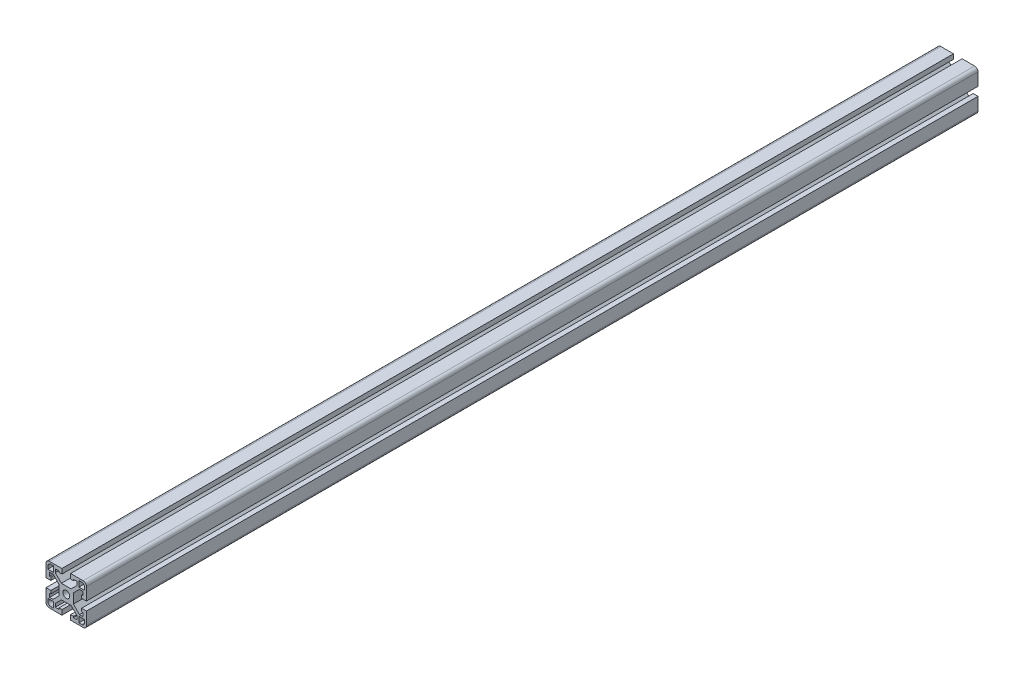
ISO-10303-21;
HEADER;
FILE_DESCRIPTION(('STEP AP214'),'2;1');
FILE_NAME('part.step','',(''),(''),'','','');
FILE_SCHEMA(('AUTOMOTIVE_DESIGN { 1 0 10303 214 1 1 1 1 }'));
ENDSEC;
DATA;
#1=APPLICATION_CONTEXT('core data for automotive mechanical design processes');
#2=APPLICATION_PROTOCOL_DEFINITION('international standard','automotive_design',2000,#1);
#3=PRODUCT_CONTEXT('',#1,'mechanical');
#4=PRODUCT('Part','Part','',(#3));
#5=PRODUCT_RELATED_PRODUCT_CATEGORY('part','',(#4));
#6=PRODUCT_DEFINITION_FORMATION('','',#4);
#7=PRODUCT_DEFINITION_CONTEXT('part definition',#1,'design');
#8=PRODUCT_DEFINITION('design','',#6,#7);
#9=PRODUCT_DEFINITION_SHAPE('','',#8);
#10=(LENGTH_UNIT() NAMED_UNIT(*) SI_UNIT(.MILLI.,.METRE.));
#11=(NAMED_UNIT(*) PLANE_ANGLE_UNIT() SI_UNIT($,.RADIAN.));
#12=(NAMED_UNIT(*) SI_UNIT($,.STERADIAN.) SOLID_ANGLE_UNIT());
#13=UNCERTAINTY_MEASURE_WITH_UNIT(LENGTH_MEASURE(1.E-05),#10,'distance_accuracy_value','');
#14=(GEOMETRIC_REPRESENTATION_CONTEXT(3) GLOBAL_UNCERTAINTY_ASSIGNED_CONTEXT((#13)) GLOBAL_UNIT_ASSIGNED_CONTEXT((#10,
#11,#12)) REPRESENTATION_CONTEXT('',''));
#15=CARTESIAN_POINT('',(0.,0.,0.));
#16=DIRECTION('',(0.,0.,1.));
#17=DIRECTION('',(1.,0.,0.));
#18=AXIS2_PLACEMENT_3D('',#15,#16,#17);
#19=CARTESIAN_POINT('',(-12.4422614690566,10.287,-892.970536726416));
#20=DIRECTION('',(-0.707106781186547,-0.707106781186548,0.));
#21=DIRECTION('',(0.707106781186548,-0.707106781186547,0.));
#22=AXIS2_PLACEMENT_3D('',#19,#20,#21);
#23=PLANE('',#22);
#24=DIRECTION('',(0.,0.,1.));
#25=VECTOR('',#24,1.);
#26=CARTESIAN_POINT('',(-12.4422614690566,10.287,-892.970536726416));
#27=LINE('',#26,#25);
#28=CARTESIAN_POINT('',(-12.4422614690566,10.287,-839.089000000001));
#29=VERTEX_POINT('',#28);
#30=CARTESIAN_POINT('',(-12.4422614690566,10.287,0.));
#31=VERTEX_POINT('',#30);
#32=EDGE_CURVE('E575',#29,#31,#27,.T.);
#33=ORIENTED_EDGE('',*,*,#32,.F.);
#34=DIRECTION('',(0.707106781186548,-0.707106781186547,0.));
#35=VECTOR('',#34,1.);
#36=CARTESIAN_POINT('',(-12.4422614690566,10.287,-839.089000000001));
#37=LINE('',#36,#35);
#38=CARTESIAN_POINT('',(-6.731,4.57573853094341,-839.089000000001));
#39=VERTEX_POINT('',#38);
#40=EDGE_CURVE('E757',#29,#39,#37,.T.);
#41=ORIENTED_EDGE('',*,*,#40,.T.);
#42=DIRECTION('',(0.,0.,1.));
#43=VECTOR('',#42,1.);
#44=CARTESIAN_POINT('',(-6.731,4.57573853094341,-892.970536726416));
#45=LINE('',#44,#43);
#46=CARTESIAN_POINT('',(-6.731,4.57573853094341,0.));
#47=VERTEX_POINT('',#46);
#48=EDGE_CURVE('E755',#39,#47,#45,.T.);
#49=ORIENTED_EDGE('',*,*,#48,.T.);
#50=DIRECTION('',(0.707106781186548,-0.707106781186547,0.));
#51=VECTOR('',#50,1.);
#52=CARTESIAN_POINT('',(-12.4422614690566,10.287,0.));
#53=LINE('',#52,#51);
#54=EDGE_CURVE('E828',#31,#47,#53,.T.);
#55=ORIENTED_EDGE('',*,*,#54,.F.);
#56=EDGE_LOOP('',(#33,#41,#49,#55));
#57=FACE_BOUND('',#56,.T.);
#58=ADVANCED_FACE('F33',(#57),#23,.T.);
#59=CARTESIAN_POINT('',(-15.6718,10.2870000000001,-892.970536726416));
#60=DIRECTION('',(0.,-1.,0.));
#61=DIRECTION('',(1.,0.,0.));
#62=AXIS2_PLACEMENT_3D('',#59,#60,#61);
#63=PLANE('',#62);
#64=DIRECTION('',(0.,0.,1.));
#65=VECTOR('',#64,1.);
#66=CARTESIAN_POINT('',(-15.6718,10.2870000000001,-892.970536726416));
#67=LINE('',#66,#65);
#68=CARTESIAN_POINT('',(-15.6718,10.2870000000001,-839.089000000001));
#69=VERTEX_POINT('',#68);
#70=CARTESIAN_POINT('',(-15.6718,10.2870000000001,0.));
#71=VERTEX_POINT('',#70);
#72=EDGE_CURVE('E579',#69,#71,#67,.T.);
#73=ORIENTED_EDGE('',*,*,#72,.F.);
#74=DIRECTION('',(1.,0.,0.));
#75=VECTOR('',#74,1.);
#76=CARTESIAN_POINT('',(-15.6718,10.2870000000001,-839.089000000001));
#77=LINE('',#76,#75);
#78=EDGE_CURVE('E578',#69,#29,#77,.T.);
#79=ORIENTED_EDGE('',*,*,#78,.T.);
#80=ORIENTED_EDGE('',*,*,#32,.T.);
#81=DIRECTION('',(1.,0.,0.));
#82=VECTOR('',#81,1.);
#83=CARTESIAN_POINT('',(-15.6718,10.2870000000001,0.));
#84=LINE('',#83,#82);
#85=EDGE_CURVE('E837',#71,#31,#84,.T.);
#86=ORIENTED_EDGE('',*,*,#85,.F.);
#87=EDGE_LOOP('',(#73,#79,#80,#86));
#88=FACE_BOUND('',#87,.T.);
#89=ADVANCED_FACE('F1067',(#88),#63,.T.);
#90=CARTESIAN_POINT('',(-15.6718,6.85800000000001,-892.970536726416));
#91=DIRECTION('',(1.,0.,0.));
#92=DIRECTION('',(0.,0.,-1.));
#93=AXIS2_PLACEMENT_3D('',#90,#91,#92);
#94=PLANE('',#93);
#95=DIRECTION('',(0.,0.,1.));
#96=VECTOR('',#95,1.);
#97=CARTESIAN_POINT('',(-15.6718,6.85800000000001,-892.970536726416));
#98=LINE('',#97,#96);
#99=CARTESIAN_POINT('',(-15.6718,6.85800000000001,-839.089000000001));
#100=VERTEX_POINT('',#99);
#101=CARTESIAN_POINT('',(-15.6718,6.85800000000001,0.));
#102=VERTEX_POINT('',#101);
#103=EDGE_CURVE('E582',#100,#102,#98,.T.);
#104=ORIENTED_EDGE('',*,*,#103,.F.);
#105=DIRECTION('',(0.,1.,0.));
#106=VECTOR('',#105,1.);
#107=CARTESIAN_POINT('',(-15.6718,6.85800000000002,-839.089000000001));
#108=LINE('',#107,#106);
#109=EDGE_CURVE('E577',#100,#69,#108,.T.);
#110=ORIENTED_EDGE('',*,*,#109,.T.);
#111=ORIENTED_EDGE('',*,*,#72,.T.);
#112=DIRECTION('',(0.,1.,0.));
#113=VECTOR('',#112,1.);
#114=CARTESIAN_POINT('',(-15.6718,6.85800000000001,0.));
#115=LINE('',#114,#113);
#116=EDGE_CURVE('E1453',#102,#71,#115,.T.);
#117=ORIENTED_EDGE('',*,*,#116,.F.);
#118=EDGE_LOOP('',(#104,#110,#111,#117));
#119=FACE_BOUND('',#118,.T.);
#120=ADVANCED_FACE('F1073',(#119),#94,.T.);
#121=CARTESIAN_POINT('',(-14.478,6.85800000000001,-892.970536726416));
#122=DIRECTION('',(0.,1.,0.));
#123=DIRECTION('',(0.,0.,1.));
#124=AXIS2_PLACEMENT_3D('',#121,#122,#123);
#125=PLANE('',#124);
#126=DIRECTION('',(0.,0.,1.));
#127=VECTOR('',#126,1.);
#128=CARTESIAN_POINT('',(-14.478,6.85800000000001,-892.970536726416));
#129=LINE('',#128,#127);
#130=CARTESIAN_POINT('',(-14.478,6.85800000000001,-839.089000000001));
#131=VERTEX_POINT('',#130);
#132=CARTESIAN_POINT('',(-14.478,6.85800000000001,0.));
#133=VERTEX_POINT('',#132);
#134=EDGE_CURVE('E585',#131,#133,#129,.T.);
#135=ORIENTED_EDGE('',*,*,#134,.F.);
#136=DIRECTION('',(-1.,0.,0.));
#137=VECTOR('',#136,1.);
#138=CARTESIAN_POINT('',(-14.478,6.85800000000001,-839.089000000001));
#139=LINE('',#138,#137);
#140=EDGE_CURVE('E581',#131,#100,#139,.T.);
#141=ORIENTED_EDGE('',*,*,#140,.T.);
#142=ORIENTED_EDGE('',*,*,#103,.T.);
#143=DIRECTION('',(-1.,0.,0.));
#144=VECTOR('',#143,1.);
#145=CARTESIAN_POINT('',(-14.478,6.85800000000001,0.));
#146=LINE('',#145,#144);
#147=EDGE_CURVE('E1462',#133,#102,#146,.T.);
#148=ORIENTED_EDGE('',*,*,#147,.F.);
#149=EDGE_LOOP('',(#135,#141,#142,#148));
#150=FACE_BOUND('',#149,.T.);
#151=ADVANCED_FACE('F1442',(#150),#125,.T.);
#152=CARTESIAN_POINT('',(-14.478,4.06400000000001,-892.970536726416));
#153=DIRECTION('',(1.,0.,0.));
#154=DIRECTION('',(0.,0.,-1.));
#155=AXIS2_PLACEMENT_3D('',#152,#153,#154);
#156=PLANE('',#155);
#157=DIRECTION('',(0.,0.,1.));
#158=VECTOR('',#157,1.);
#159=CARTESIAN_POINT('',(-14.478,4.06400000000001,-892.970536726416));
#160=LINE('',#159,#158);
#161=CARTESIAN_POINT('',(-14.478,4.06400000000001,-839.089000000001));
#162=VERTEX_POINT('',#161);
#163=CARTESIAN_POINT('',(-14.478,4.06400000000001,0.));
#164=VERTEX_POINT('',#163);
#165=EDGE_CURVE('E588',#162,#164,#160,.T.);
#166=ORIENTED_EDGE('',*,*,#165,.F.);
#167=DIRECTION('',(0.,1.,0.));
#168=VECTOR('',#167,1.);
#169=CARTESIAN_POINT('',(-14.478,4.06400000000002,-839.089000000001));
#170=LINE('',#169,#168);
#171=EDGE_CURVE('E584',#162,#131,#170,.T.);
#172=ORIENTED_EDGE('',*,*,#171,.T.);
#173=ORIENTED_EDGE('',*,*,#134,.T.);
#174=DIRECTION('',(0.,1.,0.));
#175=VECTOR('',#174,1.);
#176=CARTESIAN_POINT('',(-14.478,4.06400000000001,0.));
#177=LINE('',#176,#175);
#178=EDGE_CURVE('E1465',#164,#133,#177,.T.);
#179=ORIENTED_EDGE('',*,*,#178,.F.);
#180=EDGE_LOOP('',(#166,#172,#173,#179));
#181=FACE_BOUND('',#180,.T.);
#182=ADVANCED_FACE('F1438',(#181),#156,.T.);
#183=CARTESIAN_POINT('',(-19.05,4.06400000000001,-892.970536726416));
#184=DIRECTION('',(0.,-1.,0.));
#185=DIRECTION('',(1.,0.,0.));
#186=AXIS2_PLACEMENT_3D('',#183,#184,#185);
#187=PLANE('',#186);
#188=DIRECTION('',(0.,0.,1.));
#189=VECTOR('',#188,1.);
#190=CARTESIAN_POINT('',(-19.05,4.06400000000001,-892.970536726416));
#191=LINE('',#190,#189);
#192=CARTESIAN_POINT('',(-19.05,4.06400000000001,-839.089000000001));
#193=VERTEX_POINT('',#192);
#194=CARTESIAN_POINT('',(-19.05,4.06400000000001,0.));
#195=VERTEX_POINT('',#194);
#196=EDGE_CURVE('E591',#193,#195,#191,.T.);
#197=ORIENTED_EDGE('',*,*,#196,.F.);
#198=DIRECTION('',(1.,0.,0.));
#199=VECTOR('',#198,1.);
#200=CARTESIAN_POINT('',(-19.05,4.06400000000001,-839.089000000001));
#201=LINE('',#200,#199);
#202=EDGE_CURVE('E587',#193,#162,#201,.T.);
#203=ORIENTED_EDGE('',*,*,#202,.T.);
#204=ORIENTED_EDGE('',*,*,#165,.T.);
#205=DIRECTION('',(1.,0.,0.));
#206=VECTOR('',#205,1.);
#207=CARTESIAN_POINT('',(-19.05,4.06400000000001,0.));
#208=LINE('',#207,#206);
#209=EDGE_CURVE('E1469',#195,#164,#208,.T.);
#210=ORIENTED_EDGE('',*,*,#209,.F.);
#211=EDGE_LOOP('',(#197,#203,#204,#210));
#212=FACE_BOUND('',#211,.T.);
#213=ADVANCED_FACE('F1434',(#212),#187,.T.);
#214=CARTESIAN_POINT('',(-19.05,15.875,-892.970536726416));
#215=DIRECTION('',(-1.,0.,0.));
#216=DIRECTION('',(0.,-1.,0.));
#217=AXIS2_PLACEMENT_3D('',#214,#215,#216);
#218=PLANE('',#217);
#219=DIRECTION('',(0.,0.,1.));
#220=VECTOR('',#219,1.);
#221=CARTESIAN_POINT('',(-19.05,15.875,-892.970536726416));
#222=LINE('',#221,#220);
#223=CARTESIAN_POINT('',(-19.05,15.875,-839.089000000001));
#224=VERTEX_POINT('',#223);
#225=CARTESIAN_POINT('',(-19.05,15.875,0.));
#226=VERTEX_POINT('',#225);
#227=EDGE_CURVE('E594',#224,#226,#222,.T.);
#228=ORIENTED_EDGE('',*,*,#227,.F.);
#229=DIRECTION('',(0.,-1.,0.));
#230=VECTOR('',#229,1.);
#231=CARTESIAN_POINT('',(-19.05,15.875,-839.089000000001));
#232=LINE('',#231,#230);
#233=EDGE_CURVE('E590',#224,#193,#232,.T.);
#234=ORIENTED_EDGE('',*,*,#233,.T.);
#235=ORIENTED_EDGE('',*,*,#196,.T.);
#236=DIRECTION('',(0.,-1.,0.));
#237=VECTOR('',#236,1.);
#238=CARTESIAN_POINT('',(-19.05,15.875,0.));
#239=LINE('',#238,#237);
#240=EDGE_CURVE('E1472',#226,#195,#239,.T.);
#241=ORIENTED_EDGE('',*,*,#240,.F.);
#242=EDGE_LOOP('',(#228,#234,#235,#241));
#243=FACE_BOUND('',#242,.T.);
#244=ADVANCED_FACE('F1430',(#243),#218,.T.);
#245=CARTESIAN_POINT('',(-15.875,15.875,-892.970536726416));
#246=DIRECTION('',(0.,0.,1.));
#247=DIRECTION('',(1.,0.,0.));
#248=AXIS2_PLACEMENT_3D('',#245,#246,#247);
#249=CYLINDRICAL_SURFACE('',#248,3.17499999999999);
#250=DIRECTION('',(0.,0.,1.));
#251=VECTOR('',#250,1.);
#252=CARTESIAN_POINT('',(-15.875,19.05,-892.970536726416));
#253=LINE('',#252,#251);
#254=CARTESIAN_POINT('',(-15.875,19.05,-839.089000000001));
#255=VERTEX_POINT('',#254);
#256=CARTESIAN_POINT('',(-15.875,19.05,0.));
#257=VERTEX_POINT('',#256);
#258=EDGE_CURVE('E597',#255,#257,#253,.T.);
#259=ORIENTED_EDGE('',*,*,#258,.F.);
#260=CARTESIAN_POINT('',(-15.875,15.875,-839.089000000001));
#261=DIRECTION('',(0.,0.,-1.));
#262=DIRECTION('',(0.,1.,0.));
#263=AXIS2_PLACEMENT_3D('',#260,#261,#262);
#264=CIRCLE('',#263,3.17499999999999);
#265=EDGE_CURVE('E593',#255,#224,#264,.F.);
#266=ORIENTED_EDGE('',*,*,#265,.T.);
#267=ORIENTED_EDGE('',*,*,#227,.T.);
#268=CARTESIAN_POINT('',(-15.875,15.875,0.));
#269=DIRECTION('',(0.,0.,1.));
#270=DIRECTION('',(1.,0.,0.));
#271=AXIS2_PLACEMENT_3D('',#268,#269,#270);
#272=CIRCLE('',#271,3.17499999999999);
#273=EDGE_CURVE('E1475',#257,#226,#272,.T.);
#274=ORIENTED_EDGE('',*,*,#273,.F.);
#275=EDGE_LOOP('',(#259,#266,#267,#274));
#276=FACE_BOUND('',#275,.T.);
#277=ADVANCED_FACE('F1426',(#276),#249,.T.);
#278=CARTESIAN_POINT('',(-4.06400000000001,19.05,-892.970536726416));
#279=DIRECTION('',(0.,1.,0.));
#280=DIRECTION('',(-1.,0.,0.));
#281=AXIS2_PLACEMENT_3D('',#278,#279,#280);
#282=PLANE('',#281);
#283=DIRECTION('',(0.,0.,1.));
#284=VECTOR('',#283,1.);
#285=CARTESIAN_POINT('',(-4.06400000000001,19.05,-892.970536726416));
#286=LINE('',#285,#284);
#287=CARTESIAN_POINT('',(-4.06400000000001,19.05,-839.089000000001));
#288=VERTEX_POINT('',#287);
#289=CARTESIAN_POINT('',(-4.06400000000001,19.05,0.));
#290=VERTEX_POINT('',#289);
#291=EDGE_CURVE('E600',#288,#290,#286,.T.);
#292=ORIENTED_EDGE('',*,*,#291,.F.);
#293=DIRECTION('',(-1.,0.,0.));
#294=VECTOR('',#293,1.);
#295=CARTESIAN_POINT('',(-4.06400000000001,19.05,-839.089000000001));
#296=LINE('',#295,#294);
#297=EDGE_CURVE('E596',#288,#255,#296,.T.);
#298=ORIENTED_EDGE('',*,*,#297,.T.);
#299=ORIENTED_EDGE('',*,*,#258,.T.);
#300=DIRECTION('',(-1.,0.,0.));
#301=VECTOR('',#300,1.);
#302=CARTESIAN_POINT('',(-4.06400000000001,19.05,0.));
#303=LINE('',#302,#301);
#304=EDGE_CURVE('E1478',#290,#257,#303,.T.);
#305=ORIENTED_EDGE('',*,*,#304,.F.);
#306=EDGE_LOOP('',(#292,#298,#299,#305));
#307=FACE_BOUND('',#306,.T.);
#308=ADVANCED_FACE('F1422',(#307),#282,.T.);
#309=CARTESIAN_POINT('',(-4.064,14.478,-892.970536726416));
#310=DIRECTION('',(1.,0.,0.));
#311=DIRECTION('',(0.,1.,0.));
#312=AXIS2_PLACEMENT_3D('',#309,#310,#311);
#313=PLANE('',#312);
#314=DIRECTION('',(0.,0.,1.));
#315=VECTOR('',#314,1.);
#316=CARTESIAN_POINT('',(-4.064,14.478,-892.970536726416));
#317=LINE('',#316,#315);
#318=CARTESIAN_POINT('',(-4.06400000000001,14.478,-839.089000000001));
#319=VERTEX_POINT('',#318);
#320=CARTESIAN_POINT('',(-4.064,14.478,0.));
#321=VERTEX_POINT('',#320);
#322=EDGE_CURVE('E603',#319,#321,#317,.T.);
#323=ORIENTED_EDGE('',*,*,#322,.F.);
#324=DIRECTION('',(0.,1.,0.));
#325=VECTOR('',#324,1.);
#326=CARTESIAN_POINT('',(-4.064,14.478,-839.089000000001));
#327=LINE('',#326,#325);
#328=EDGE_CURVE('E599',#319,#288,#327,.T.);
#329=ORIENTED_EDGE('',*,*,#328,.T.);
#330=ORIENTED_EDGE('',*,*,#291,.T.);
#331=DIRECTION('',(0.,1.,0.));
#332=VECTOR('',#331,1.);
#333=CARTESIAN_POINT('',(-4.064,14.478,0.));
#334=LINE('',#333,#332);
#335=EDGE_CURVE('E1481',#321,#290,#334,.T.);
#336=ORIENTED_EDGE('',*,*,#335,.F.);
#337=EDGE_LOOP('',(#323,#329,#330,#336));
#338=FACE_BOUND('',#337,.T.);
#339=ADVANCED_FACE('F1418',(#338),#313,.T.);
#340=CARTESIAN_POINT('',(-6.858,14.478,-892.970536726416));
#341=DIRECTION('',(0.,-1.,0.));
#342=DIRECTION('',(0.,0.,-1.));
#343=AXIS2_PLACEMENT_3D('',#340,#341,#342);
#344=PLANE('',#343);
#345=DIRECTION('',(0.,0.,1.));
#346=VECTOR('',#345,1.);
#347=CARTESIAN_POINT('',(-6.858,14.478,-892.970536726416));
#348=LINE('',#347,#346);
#349=CARTESIAN_POINT('',(-6.858,14.478,-839.089000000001));
#350=VERTEX_POINT('',#349);
#351=CARTESIAN_POINT('',(-6.858,14.478,0.));
#352=VERTEX_POINT('',#351);
#353=EDGE_CURVE('E606',#350,#352,#348,.T.);
#354=ORIENTED_EDGE('',*,*,#353,.F.);
#355=DIRECTION('',(1.,0.,0.));
#356=VECTOR('',#355,1.);
#357=CARTESIAN_POINT('',(-6.858,14.478,-839.089000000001));
#358=LINE('',#357,#356);
#359=EDGE_CURVE('E602',#350,#319,#358,.T.);
#360=ORIENTED_EDGE('',*,*,#359,.T.);
#361=ORIENTED_EDGE('',*,*,#322,.T.);
#362=DIRECTION('',(1.,0.,0.));
#363=VECTOR('',#362,1.);
#364=CARTESIAN_POINT('',(-6.858,14.478,0.));
#365=LINE('',#364,#363);
#366=EDGE_CURVE('E1484',#352,#321,#365,.T.);
#367=ORIENTED_EDGE('',*,*,#366,.F.);
#368=EDGE_LOOP('',(#354,#360,#361,#367));
#369=FACE_BOUND('',#368,.T.);
#370=ADVANCED_FACE('F1414',(#369),#344,.T.);
#371=CARTESIAN_POINT('',(-6.858,15.6718,-892.970536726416));
#372=DIRECTION('',(-1.,0.,0.));
#373=DIRECTION('',(0.,0.,1.));
#374=AXIS2_PLACEMENT_3D('',#371,#372,#373);
#375=PLANE('',#374);
#376=DIRECTION('',(0.,0.,1.));
#377=VECTOR('',#376,1.);
#378=CARTESIAN_POINT('',(-6.858,15.6718,-892.970536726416));
#379=LINE('',#378,#377);
#380=CARTESIAN_POINT('',(-6.858,15.6718,-839.089000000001));
#381=VERTEX_POINT('',#380);
#382=CARTESIAN_POINT('',(-6.858,15.6718,0.));
#383=VERTEX_POINT('',#382);
#384=EDGE_CURVE('E609',#381,#383,#379,.T.);
#385=ORIENTED_EDGE('',*,*,#384,.F.);
#386=DIRECTION('',(0.,-1.,0.));
#387=VECTOR('',#386,1.);
#388=CARTESIAN_POINT('',(-6.858,15.6718,-839.089000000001));
#389=LINE('',#388,#387);
#390=EDGE_CURVE('E605',#381,#350,#389,.T.);
#391=ORIENTED_EDGE('',*,*,#390,.T.);
#392=ORIENTED_EDGE('',*,*,#353,.T.);
#393=DIRECTION('',(0.,-1.,0.));
#394=VECTOR('',#393,1.);
#395=CARTESIAN_POINT('',(-6.858,15.6718,0.));
#396=LINE('',#395,#394);
#397=EDGE_CURVE('E1487',#383,#352,#396,.T.);
#398=ORIENTED_EDGE('',*,*,#397,.F.);
#399=EDGE_LOOP('',(#385,#391,#392,#398));
#400=FACE_BOUND('',#399,.T.);
#401=ADVANCED_FACE('F1410',(#400),#375,.T.);
#402=CARTESIAN_POINT('',(-10.287,15.6718,-892.970536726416));
#403=DIRECTION('',(0.,-1.,0.));
#404=DIRECTION('',(0.,0.,-1.));
#405=AXIS2_PLACEMENT_3D('',#402,#403,#404);
#406=PLANE('',#405);
#407=DIRECTION('',(0.,0.,1.));
#408=VECTOR('',#407,1.);
#409=CARTESIAN_POINT('',(-10.287,15.6718,-892.970536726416));
#410=LINE('',#409,#408);
#411=CARTESIAN_POINT('',(-10.287,15.6718,-839.089000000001));
#412=VERTEX_POINT('',#411);
#413=CARTESIAN_POINT('',(-10.287,15.6718,0.));
#414=VERTEX_POINT('',#413);
#415=EDGE_CURVE('E612',#412,#414,#410,.T.);
#416=ORIENTED_EDGE('',*,*,#415,.F.);
#417=DIRECTION('',(1.,0.,0.));
#418=VECTOR('',#417,1.);
#419=CARTESIAN_POINT('',(-10.287,15.6718,-839.089000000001));
#420=LINE('',#419,#418);
#421=EDGE_CURVE('E608',#412,#381,#420,.T.);
#422=ORIENTED_EDGE('',*,*,#421,.T.);
#423=ORIENTED_EDGE('',*,*,#384,.T.);
#424=DIRECTION('',(1.,0.,0.));
#425=VECTOR('',#424,1.);
#426=CARTESIAN_POINT('',(-10.287,15.6718,0.));
#427=LINE('',#426,#425);
#428=EDGE_CURVE('E1490',#414,#383,#427,.T.);
#429=ORIENTED_EDGE('',*,*,#428,.F.);
#430=EDGE_LOOP('',(#416,#422,#423,#429));
#431=FACE_BOUND('',#430,.T.);
#432=ADVANCED_FACE('F1406',(#431),#406,.T.);
#433=CARTESIAN_POINT('',(-10.287,12.4422614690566,-892.970536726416));
#434=DIRECTION('',(1.,0.,0.));
#435=DIRECTION('',(0.,1.,0.));
#436=AXIS2_PLACEMENT_3D('',#433,#434,#435);
#437=PLANE('',#436);
#438=DIRECTION('',(0.,0.,1.));
#439=VECTOR('',#438,1.);
#440=CARTESIAN_POINT('',(-10.287,12.4422614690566,-892.970536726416));
#441=LINE('',#440,#439);
#442=CARTESIAN_POINT('',(-10.287,12.4422614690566,-839.089000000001));
#443=VERTEX_POINT('',#442);
#444=CARTESIAN_POINT('',(-10.287,12.4422614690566,0.));
#445=VERTEX_POINT('',#444);
#446=EDGE_CURVE('E615',#443,#445,#441,.T.);
#447=ORIENTED_EDGE('',*,*,#446,.F.);
#448=DIRECTION('',(0.,1.,0.));
#449=VECTOR('',#448,1.);
#450=CARTESIAN_POINT('',(-10.287,12.4422614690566,-839.089000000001));
#451=LINE('',#450,#449);
#452=EDGE_CURVE('E611',#443,#412,#451,.T.);
#453=ORIENTED_EDGE('',*,*,#452,.T.);
#454=ORIENTED_EDGE('',*,*,#415,.T.);
#455=DIRECTION('',(0.,1.,0.));
#456=VECTOR('',#455,1.);
#457=CARTESIAN_POINT('',(-10.287,12.4422614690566,0.));
#458=LINE('',#457,#456);
#459=EDGE_CURVE('E1493',#445,#414,#458,.T.);
#460=ORIENTED_EDGE('',*,*,#459,.F.);
#461=EDGE_LOOP('',(#447,#453,#454,#460));
#462=FACE_BOUND('',#461,.T.);
#463=ADVANCED_FACE('F1402',(#462),#437,.T.);
#464=CARTESIAN_POINT('',(-4.57573853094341,6.73100000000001,-892.970536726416));
#465=DIRECTION('',(0.707106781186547,0.707106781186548,0.));
#466=DIRECTION('',(-0.707106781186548,0.707106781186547,0.));
#467=AXIS2_PLACEMENT_3D('',#464,#465,#466);
#468=PLANE('',#467);
#469=DIRECTION('',(0.,0.,1.));
#470=VECTOR('',#469,1.);
#471=CARTESIAN_POINT('',(-4.57573853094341,6.73100000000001,-892.970536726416));
#472=LINE('',#471,#470);
#473=CARTESIAN_POINT('',(-4.57573853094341,6.73100000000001,-839.089000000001));
#474=VERTEX_POINT('',#473);
#475=CARTESIAN_POINT('',(-4.57573853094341,6.73100000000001,0.));
#476=VERTEX_POINT('',#475);
#477=EDGE_CURVE('E618',#474,#476,#472,.T.);
#478=ORIENTED_EDGE('',*,*,#477,.F.);
#479=DIRECTION('',(-0.707106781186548,0.707106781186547,0.));
#480=VECTOR('',#479,1.);
#481=CARTESIAN_POINT('',(-4.57573853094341,6.73100000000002,-839.089000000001));
#482=LINE('',#481,#480);
#483=EDGE_CURVE('E614',#474,#443,#482,.T.);
#484=ORIENTED_EDGE('',*,*,#483,.T.);
#485=ORIENTED_EDGE('',*,*,#446,.T.);
#486=DIRECTION('',(-0.707106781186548,0.707106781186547,0.));
#487=VECTOR('',#486,1.);
#488=CARTESIAN_POINT('',(-4.57573853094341,6.73100000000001,0.));
#489=LINE('',#488,#487);
#490=EDGE_CURVE('E1496',#476,#445,#489,.T.);
#491=ORIENTED_EDGE('',*,*,#490,.F.);
#492=EDGE_LOOP('',(#478,#484,#485,#491));
#493=FACE_BOUND('',#492,.T.);
#494=ADVANCED_FACE('F1398',(#493),#468,.T.);
#495=CARTESIAN_POINT('',(4.57573853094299,6.73100000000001,-892.970536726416));
#496=DIRECTION('',(0.,1.,0.));
#497=DIRECTION('',(0.,0.,1.));
#498=AXIS2_PLACEMENT_3D('',#495,#496,#497);
#499=PLANE('',#498);
#500=DIRECTION('',(0.,0.,1.));
#501=VECTOR('',#500,1.);
#502=CARTESIAN_POINT('',(4.57573853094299,6.73100000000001,-892.970536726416));
#503=LINE('',#502,#501);
#504=CARTESIAN_POINT('',(4.575738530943,6.73100000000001,-839.089000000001));
#505=VERTEX_POINT('',#504);
#506=CARTESIAN_POINT('',(4.57573853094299,6.73100000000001,0.));
#507=VERTEX_POINT('',#506);
#508=EDGE_CURVE('E621',#505,#507,#503,.T.);
#509=ORIENTED_EDGE('',*,*,#508,.F.);
#510=DIRECTION('',(-1.,0.,0.));
#511=VECTOR('',#510,1.);
#512=CARTESIAN_POINT('',(4.57573853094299,6.73100000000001,-839.089000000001));
#513=LINE('',#512,#511);
#514=EDGE_CURVE('E617',#505,#474,#513,.T.);
#515=ORIENTED_EDGE('',*,*,#514,.T.);
#516=ORIENTED_EDGE('',*,*,#477,.T.);
#517=DIRECTION('',(-1.,0.,0.));
#518=VECTOR('',#517,1.);
#519=CARTESIAN_POINT('',(4.57573853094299,6.73100000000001,0.));
#520=LINE('',#519,#518);
#521=EDGE_CURVE('E1499',#507,#476,#520,.T.);
#522=ORIENTED_EDGE('',*,*,#521,.F.);
#523=EDGE_LOOP('',(#509,#515,#516,#522));
#524=FACE_BOUND('',#523,.T.);
#525=ADVANCED_FACE('F1394',(#524),#499,.T.);
#526=CARTESIAN_POINT('',(10.2869999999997,12.4422614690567,-892.970536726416));
#527=DIRECTION('',(-0.707106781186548,0.707106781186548,0.));
#528=DIRECTION('',(-0.707106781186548,-0.707106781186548,0.));
#529=AXIS2_PLACEMENT_3D('',#526,#527,#528);
#530=PLANE('',#529);
#531=DIRECTION('',(0.,0.,1.));
#532=VECTOR('',#531,1.);
#533=CARTESIAN_POINT('',(10.2869999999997,12.4422614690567,-892.970536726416));
#534=LINE('',#533,#532);
#535=CARTESIAN_POINT('',(10.2869999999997,12.4422614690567,-839.089000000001));
#536=VERTEX_POINT('',#535);
#537=CARTESIAN_POINT('',(10.2869999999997,12.4422614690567,0.));
#538=VERTEX_POINT('',#537);
#539=EDGE_CURVE('E624',#536,#538,#534,.T.);
#540=ORIENTED_EDGE('',*,*,#539,.F.);
#541=DIRECTION('',(-0.707106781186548,-0.707106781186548,0.));
#542=VECTOR('',#541,1.);
#543=CARTESIAN_POINT('',(10.2869999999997,12.4422614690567,-839.089000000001));
#544=LINE('',#543,#542);
#545=EDGE_CURVE('E620',#536,#505,#544,.T.);
#546=ORIENTED_EDGE('',*,*,#545,.T.);
#547=ORIENTED_EDGE('',*,*,#508,.T.);
#548=DIRECTION('',(-0.707106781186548,-0.707106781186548,0.));
#549=VECTOR('',#548,1.);
#550=CARTESIAN_POINT('',(10.2869999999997,12.4422614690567,0.));
#551=LINE('',#550,#549);
#552=EDGE_CURVE('E1502',#538,#507,#551,.T.);
#553=ORIENTED_EDGE('',*,*,#552,.F.);
#554=EDGE_LOOP('',(#540,#546,#547,#553));
#555=FACE_BOUND('',#554,.T.);
#556=ADVANCED_FACE('F1390',(#555),#530,.T.);
#557=CARTESIAN_POINT('',(10.2869999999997,15.6718000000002,-892.970536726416));
#558=DIRECTION('',(-1.,0.,0.));
#559=DIRECTION('',(0.,-1.,0.));
#560=AXIS2_PLACEMENT_3D('',#557,#558,#559);
#561=PLANE('',#560);
#562=DIRECTION('',(0.,0.,1.));
#563=VECTOR('',#562,1.);
#564=CARTESIAN_POINT('',(10.2869999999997,15.6718000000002,-892.970536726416));
#565=LINE('',#564,#563);
#566=CARTESIAN_POINT('',(10.2869999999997,15.6718000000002,-839.089000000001));
#567=VERTEX_POINT('',#566);
#568=CARTESIAN_POINT('',(10.2869999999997,15.6718000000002,0.));
#569=VERTEX_POINT('',#568);
#570=EDGE_CURVE('E627',#567,#569,#565,.T.);
#571=ORIENTED_EDGE('',*,*,#570,.F.);
#572=DIRECTION('',(0.,-1.,0.));
#573=VECTOR('',#572,1.);
#574=CARTESIAN_POINT('',(10.2869999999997,15.6718000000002,-839.089000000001));
#575=LINE('',#574,#573);
#576=EDGE_CURVE('E623',#567,#536,#575,.T.);
#577=ORIENTED_EDGE('',*,*,#576,.T.);
#578=ORIENTED_EDGE('',*,*,#539,.T.);
#579=DIRECTION('',(0.,-1.,0.));
#580=VECTOR('',#579,1.);
#581=CARTESIAN_POINT('',(10.2869999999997,15.6718000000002,0.));
#582=LINE('',#581,#580);
#583=EDGE_CURVE('E1505',#569,#538,#582,.T.);
#584=ORIENTED_EDGE('',*,*,#583,.F.);
#585=EDGE_LOOP('',(#571,#577,#578,#584));
#586=FACE_BOUND('',#585,.T.);
#587=ADVANCED_FACE('F1386',(#586),#561,.T.);
#588=CARTESIAN_POINT('',(6.85799999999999,15.6718000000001,-892.970536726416));
#589=DIRECTION('',(0.,-1.,0.));
#590=DIRECTION('',(1.,0.,0.));
#591=AXIS2_PLACEMENT_3D('',#588,#589,#590);
#592=PLANE('',#591);
#593=DIRECTION('',(0.,0.,1.));
#594=VECTOR('',#593,1.);
#595=CARTESIAN_POINT('',(6.85799999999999,15.6718000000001,-892.970536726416));
#596=LINE('',#595,#594);
#597=CARTESIAN_POINT('',(6.85799999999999,15.6718000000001,-839.089000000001));
#598=VERTEX_POINT('',#597);
#599=CARTESIAN_POINT('',(6.85799999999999,15.6718000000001,0.));
#600=VERTEX_POINT('',#599);
#601=EDGE_CURVE('E630',#598,#600,#596,.T.);
#602=ORIENTED_EDGE('',*,*,#601,.F.);
#603=DIRECTION('',(1.,0.,0.));
#604=VECTOR('',#603,1.);
#605=CARTESIAN_POINT('',(6.85799999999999,15.6718000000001,-839.089000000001));
#606=LINE('',#605,#604);
#607=EDGE_CURVE('E626',#598,#567,#606,.T.);
#608=ORIENTED_EDGE('',*,*,#607,.T.);
#609=ORIENTED_EDGE('',*,*,#570,.T.);
#610=DIRECTION('',(1.,0.,0.));
#611=VECTOR('',#610,1.);
#612=CARTESIAN_POINT('',(6.85799999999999,15.6718000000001,0.));
#613=LINE('',#612,#611);
#614=EDGE_CURVE('E1508',#600,#569,#613,.T.);
#615=ORIENTED_EDGE('',*,*,#614,.F.);
#616=EDGE_LOOP('',(#602,#608,#609,#615));
#617=FACE_BOUND('',#616,.T.);
#618=ADVANCED_FACE('F1382',(#617),#592,.T.);
#619=CARTESIAN_POINT('',(6.85799999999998,14.478,-892.970536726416));
#620=DIRECTION('',(1.,0.,0.));
#621=DIRECTION('',(0.,1.,0.));
#622=AXIS2_PLACEMENT_3D('',#619,#620,#621);
#623=PLANE('',#622);
#624=DIRECTION('',(0.,0.,1.));
#625=VECTOR('',#624,1.);
#626=CARTESIAN_POINT('',(6.85799999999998,14.478,-892.970536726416));
#627=LINE('',#626,#625);
#628=CARTESIAN_POINT('',(6.85799999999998,14.478,-839.089000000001));
#629=VERTEX_POINT('',#628);
#630=CARTESIAN_POINT('',(6.85799999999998,14.478,0.));
#631=VERTEX_POINT('',#630);
#632=EDGE_CURVE('E633',#629,#631,#627,.T.);
#633=ORIENTED_EDGE('',*,*,#632,.F.);
#634=DIRECTION('',(0.,1.,0.));
#635=VECTOR('',#634,1.);
#636=CARTESIAN_POINT('',(6.85799999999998,14.478,-839.089000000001));
#637=LINE('',#636,#635);
#638=EDGE_CURVE('E629',#629,#598,#637,.T.);
#639=ORIENTED_EDGE('',*,*,#638,.T.);
#640=ORIENTED_EDGE('',*,*,#601,.T.);
#641=DIRECTION('',(0.,1.,0.));
#642=VECTOR('',#641,1.);
#643=CARTESIAN_POINT('',(6.85799999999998,14.478,0.));
#644=LINE('',#643,#642);
#645=EDGE_CURVE('E1511',#631,#600,#644,.T.);
#646=ORIENTED_EDGE('',*,*,#645,.F.);
#647=EDGE_LOOP('',(#633,#639,#640,#646));
#648=FACE_BOUND('',#647,.T.);
#649=ADVANCED_FACE('F1378',(#648),#623,.T.);
#650=CARTESIAN_POINT('',(4.06399999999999,14.478,-892.970536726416));
#651=DIRECTION('',(0.,-1.,0.));
#652=DIRECTION('',(1.,0.,0.));
#653=AXIS2_PLACEMENT_3D('',#650,#651,#652);
#654=PLANE('',#653);
#655=DIRECTION('',(0.,0.,1.));
#656=VECTOR('',#655,1.);
#657=CARTESIAN_POINT('',(4.06399999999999,14.478,-892.970536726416));
#658=LINE('',#657,#656);
#659=CARTESIAN_POINT('',(4.06399999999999,14.478,-839.089000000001));
#660=VERTEX_POINT('',#659);
#661=CARTESIAN_POINT('',(4.06399999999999,14.478,0.));
#662=VERTEX_POINT('',#661);
#663=EDGE_CURVE('E636',#660,#662,#658,.T.);
#664=ORIENTED_EDGE('',*,*,#663,.F.);
#665=DIRECTION('',(1.,0.,0.));
#666=VECTOR('',#665,1.);
#667=CARTESIAN_POINT('',(4.06399999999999,14.478,-839.089000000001));
#668=LINE('',#667,#666);
#669=EDGE_CURVE('E632',#660,#629,#668,.T.);
#670=ORIENTED_EDGE('',*,*,#669,.T.);
#671=ORIENTED_EDGE('',*,*,#632,.T.);
#672=DIRECTION('',(1.,0.,0.));
#673=VECTOR('',#672,1.);
#674=CARTESIAN_POINT('',(4.06399999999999,14.478,0.));
#675=LINE('',#674,#673);
#676=EDGE_CURVE('E1514',#662,#631,#675,.T.);
#677=ORIENTED_EDGE('',*,*,#676,.F.);
#678=EDGE_LOOP('',(#664,#670,#671,#677));
#679=FACE_BOUND('',#678,.T.);
#680=ADVANCED_FACE('F1374',(#679),#654,.T.);
#681=CARTESIAN_POINT('',(4.06399999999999,19.05,-892.970536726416));
#682=DIRECTION('',(-1.,0.,0.));
#683=DIRECTION('',(0.,0.,1.));
#684=AXIS2_PLACEMENT_3D('',#681,#682,#683);
#685=PLANE('',#684);
#686=DIRECTION('',(0.,0.,1.));
#687=VECTOR('',#686,1.);
#688=CARTESIAN_POINT('',(4.06399999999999,19.05,-892.970536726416));
#689=LINE('',#688,#687);
#690=CARTESIAN_POINT('',(4.06399999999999,19.05,-839.089000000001));
#691=VERTEX_POINT('',#690);
#692=CARTESIAN_POINT('',(4.06399999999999,19.05,0.));
#693=VERTEX_POINT('',#692);
#694=EDGE_CURVE('E639',#691,#693,#689,.T.);
#695=ORIENTED_EDGE('',*,*,#694,.F.);
#696=DIRECTION('',(0.,-1.,0.));
#697=VECTOR('',#696,1.);
#698=CARTESIAN_POINT('',(4.06399999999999,19.05,-839.089000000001));
#699=LINE('',#698,#697);
#700=EDGE_CURVE('E635',#691,#660,#699,.T.);
#701=ORIENTED_EDGE('',*,*,#700,.T.);
#702=ORIENTED_EDGE('',*,*,#663,.T.);
#703=DIRECTION('',(0.,-1.,0.));
#704=VECTOR('',#703,1.);
#705=CARTESIAN_POINT('',(4.06399999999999,19.05,0.));
#706=LINE('',#705,#704);
#707=EDGE_CURVE('E1517',#693,#662,#706,.T.);
#708=ORIENTED_EDGE('',*,*,#707,.F.);
#709=EDGE_LOOP('',(#695,#701,#702,#708));
#710=FACE_BOUND('',#709,.T.);
#711=ADVANCED_FACE('F1370',(#710),#685,.T.);
#712=CARTESIAN_POINT('',(15.875,19.05,-892.970536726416));
#713=DIRECTION('',(0.,1.,0.));
#714=DIRECTION('',(-1.,0.,0.));
#715=AXIS2_PLACEMENT_3D('',#712,#713,#714);
#716=PLANE('',#715);
#717=DIRECTION('',(0.,0.,1.));
#718=VECTOR('',#717,1.);
#719=CARTESIAN_POINT('',(15.875,19.05,-892.970536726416));
#720=LINE('',#719,#718);
#721=CARTESIAN_POINT('',(15.8750000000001,19.05,-839.089000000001));
#722=VERTEX_POINT('',#721);
#723=CARTESIAN_POINT('',(15.875,19.05,0.));
#724=VERTEX_POINT('',#723);
#725=EDGE_CURVE('E642',#722,#724,#720,.T.);
#726=ORIENTED_EDGE('',*,*,#725,.F.);
#727=DIRECTION('',(-1.,0.,0.));
#728=VECTOR('',#727,1.);
#729=CARTESIAN_POINT('',(15.875,19.05,-839.089000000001));
#730=LINE('',#729,#728);
#731=EDGE_CURVE('E638',#722,#691,#730,.T.);
#732=ORIENTED_EDGE('',*,*,#731,.T.);
#733=ORIENTED_EDGE('',*,*,#694,.T.);
#734=DIRECTION('',(-1.,0.,0.));
#735=VECTOR('',#734,1.);
#736=CARTESIAN_POINT('',(15.875,19.05,0.));
#737=LINE('',#736,#735);
#738=EDGE_CURVE('E1520',#724,#693,#737,.T.);
#739=ORIENTED_EDGE('',*,*,#738,.F.);
#740=EDGE_LOOP('',(#726,#732,#733,#739));
#741=FACE_BOUND('',#740,.T.);
#742=ADVANCED_FACE('F1366',(#741),#716,.T.);
#743=CARTESIAN_POINT('',(15.8750000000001,15.8750000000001,-892.970536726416));
#744=DIRECTION('',(0.,0.,1.));
#745=DIRECTION('',(1.,0.,0.));
#746=AXIS2_PLACEMENT_3D('',#743,#744,#745);
#747=CYLINDRICAL_SURFACE('',#746,3.17499999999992);
#748=DIRECTION('',(0.,0.,1.));
#749=VECTOR('',#748,1.);
#750=CARTESIAN_POINT('',(19.05,15.8750000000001,-892.970536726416));
#751=LINE('',#750,#749);
#752=CARTESIAN_POINT('',(19.05,15.8750000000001,-839.089000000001));
#753=VERTEX_POINT('',#752);
#754=CARTESIAN_POINT('',(19.05,15.8750000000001,0.));
#755=VERTEX_POINT('',#754);
#756=EDGE_CURVE('E645',#753,#755,#751,.T.);
#757=ORIENTED_EDGE('',*,*,#756,.F.);
#758=CARTESIAN_POINT('',(15.8750000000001,15.8750000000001,-839.089000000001));
#759=DIRECTION('',(0.,0.,-1.));
#760=DIRECTION('',(0.,1.,0.));
#761=AXIS2_PLACEMENT_3D('',#758,#759,#760);
#762=CIRCLE('',#761,3.17499999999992);
#763=EDGE_CURVE('E641',#753,#722,#762,.F.);
#764=ORIENTED_EDGE('',*,*,#763,.T.);
#765=ORIENTED_EDGE('',*,*,#725,.T.);
#766=CARTESIAN_POINT('',(15.8750000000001,15.8750000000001,0.));
#767=DIRECTION('',(0.,0.,1.));
#768=DIRECTION('',(1.,0.,0.));
#769=AXIS2_PLACEMENT_3D('',#766,#767,#768);
#770=CIRCLE('',#769,3.17499999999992);
#771=EDGE_CURVE('E1523',#755,#724,#770,.T.);
#772=ORIENTED_EDGE('',*,*,#771,.F.);
#773=EDGE_LOOP('',(#757,#764,#765,#772));
#774=FACE_BOUND('',#773,.T.);
#775=ADVANCED_FACE('F1362',(#774),#747,.T.);
#776=CARTESIAN_POINT('',(19.05,4.06399999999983,-892.970536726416));
#777=DIRECTION('',(1.,0.,0.));
#778=DIRECTION('',(0.,1.,0.));
#779=AXIS2_PLACEMENT_3D('',#776,#777,#778);
#780=PLANE('',#779);
#781=DIRECTION('',(0.,0.,1.));
#782=VECTOR('',#781,1.);
#783=CARTESIAN_POINT('',(19.05,4.06399999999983,-892.970536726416));
#784=LINE('',#783,#782);
#785=CARTESIAN_POINT('',(19.05,4.06399999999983,-839.089000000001));
#786=VERTEX_POINT('',#785);
#787=CARTESIAN_POINT('',(19.05,4.06399999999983,0.));
#788=VERTEX_POINT('',#787);
#789=EDGE_CURVE('E648',#786,#788,#784,.T.);
#790=ORIENTED_EDGE('',*,*,#789,.F.);
#791=DIRECTION('',(0.,1.,0.));
#792=VECTOR('',#791,1.);
#793=CARTESIAN_POINT('',(19.05,4.06399999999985,-839.089000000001));
#794=LINE('',#793,#792);
#795=EDGE_CURVE('E644',#786,#753,#794,.T.);
#796=ORIENTED_EDGE('',*,*,#795,.T.);
#797=ORIENTED_EDGE('',*,*,#756,.T.);
#798=DIRECTION('',(0.,1.,0.));
#799=VECTOR('',#798,1.);
#800=CARTESIAN_POINT('',(19.05,4.06399999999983,0.));
#801=LINE('',#800,#799);
#802=EDGE_CURVE('E1526',#788,#755,#801,.T.);
#803=ORIENTED_EDGE('',*,*,#802,.F.);
#804=EDGE_LOOP('',(#790,#796,#797,#803));
#805=FACE_BOUND('',#804,.T.);
#806=ADVANCED_FACE('F1358',(#805),#780,.T.);
#807=CARTESIAN_POINT('',(14.4780000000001,4.06399999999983,-892.970536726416));
#808=DIRECTION('',(0.,-1.,0.));
#809=DIRECTION('',(0.,0.,-1.));
#810=AXIS2_PLACEMENT_3D('',#807,#808,#809);
#811=PLANE('',#810);
#812=DIRECTION('',(0.,0.,1.));
#813=VECTOR('',#812,1.);
#814=CARTESIAN_POINT('',(14.4780000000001,4.06399999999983,-892.970536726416));
#815=LINE('',#814,#813);
#816=CARTESIAN_POINT('',(14.4780000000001,4.06399999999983,-839.089000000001));
#817=VERTEX_POINT('',#816);
#818=CARTESIAN_POINT('',(14.4780000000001,4.06399999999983,0.));
#819=VERTEX_POINT('',#818);
#820=EDGE_CURVE('E651',#817,#819,#815,.T.);
#821=ORIENTED_EDGE('',*,*,#820,.F.);
#822=DIRECTION('',(1.,0.,0.));
#823=VECTOR('',#822,1.);
#824=CARTESIAN_POINT('',(14.4780000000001,4.06399999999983,-839.089000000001));
#825=LINE('',#824,#823);
#826=EDGE_CURVE('E647',#817,#786,#825,.T.);
#827=ORIENTED_EDGE('',*,*,#826,.T.);
#828=ORIENTED_EDGE('',*,*,#789,.T.);
#829=DIRECTION('',(1.,0.,0.));
#830=VECTOR('',#829,1.);
#831=CARTESIAN_POINT('',(14.4780000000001,4.06399999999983,0.));
#832=LINE('',#831,#830);
#833=EDGE_CURVE('E1529',#819,#788,#832,.T.);
#834=ORIENTED_EDGE('',*,*,#833,.F.);
#835=EDGE_LOOP('',(#821,#827,#828,#834));
#836=FACE_BOUND('',#835,.T.);
#837=ADVANCED_FACE('F1354',(#836),#811,.T.);
#838=CARTESIAN_POINT('',(14.4780000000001,6.85799999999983,-892.970536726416));
#839=DIRECTION('',(-1.,0.,0.));
#840=DIRECTION('',(0.,0.,1.));
#841=AXIS2_PLACEMENT_3D('',#838,#839,#840);
#842=PLANE('',#841);
#843=DIRECTION('',(0.,0.,1.));
#844=VECTOR('',#843,1.);
#845=CARTESIAN_POINT('',(14.4780000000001,6.85799999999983,-892.970536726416));
#846=LINE('',#845,#844);
#847=CARTESIAN_POINT('',(14.4780000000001,6.85799999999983,-839.089000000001));
#848=VERTEX_POINT('',#847);
#849=CARTESIAN_POINT('',(14.4780000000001,6.85799999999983,0.));
#850=VERTEX_POINT('',#849);
#851=EDGE_CURVE('E654',#848,#850,#846,.T.);
#852=ORIENTED_EDGE('',*,*,#851,.F.);
#853=DIRECTION('',(0.,-1.,0.));
#854=VECTOR('',#853,1.);
#855=CARTESIAN_POINT('',(14.4780000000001,6.85799999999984,-839.089000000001));
#856=LINE('',#855,#854);
#857=EDGE_CURVE('E650',#848,#817,#856,.T.);
#858=ORIENTED_EDGE('',*,*,#857,.T.);
#859=ORIENTED_EDGE('',*,*,#820,.T.);
#860=DIRECTION('',(0.,-1.,0.));
#861=VECTOR('',#860,1.);
#862=CARTESIAN_POINT('',(14.4780000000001,6.85799999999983,0.));
#863=LINE('',#862,#861);
#864=EDGE_CURVE('E1532',#850,#819,#863,.T.);
#865=ORIENTED_EDGE('',*,*,#864,.F.);
#866=EDGE_LOOP('',(#852,#858,#859,#865));
#867=FACE_BOUND('',#866,.T.);
#868=ADVANCED_FACE('F1350',(#867),#842,.T.);
#869=CARTESIAN_POINT('',(15.6718,6.858,-892.970536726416));
#870=DIRECTION('',(-1.48217284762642E-13,1.,0.));
#871=DIRECTION('',(-1.,-1.48217284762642E-13,0.));
#872=AXIS2_PLACEMENT_3D('',#869,#870,#871);
#873=PLANE('',#872);
#874=DIRECTION('',(0.,0.,1.));
#875=VECTOR('',#874,1.);
#876=CARTESIAN_POINT('',(15.6718,6.858,-892.970536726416));
#877=LINE('',#876,#875);
#878=CARTESIAN_POINT('',(15.6718,6.858,-839.089000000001));
#879=VERTEX_POINT('',#878);
#880=CARTESIAN_POINT('',(15.6718,6.858,0.));
#881=VERTEX_POINT('',#880);
#882=EDGE_CURVE('E657',#879,#881,#877,.T.);
#883=ORIENTED_EDGE('',*,*,#882,.F.);
#884=DIRECTION('',(-1.,-1.48217284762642E-13,0.));
#885=VECTOR('',#884,1.);
#886=CARTESIAN_POINT('',(15.6718,6.858,-839.089000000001));
#887=LINE('',#886,#885);
#888=EDGE_CURVE('E653',#879,#848,#887,.T.);
#889=ORIENTED_EDGE('',*,*,#888,.T.);
#890=ORIENTED_EDGE('',*,*,#851,.T.);
#891=DIRECTION('',(-1.,-1.48217284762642E-13,0.));
#892=VECTOR('',#891,1.);
#893=CARTESIAN_POINT('',(15.6718,6.858,0.));
#894=LINE('',#893,#892);
#895=EDGE_CURVE('E1535',#881,#850,#894,.T.);
#896=ORIENTED_EDGE('',*,*,#895,.F.);
#897=EDGE_LOOP('',(#883,#889,#890,#896));
#898=FACE_BOUND('',#897,.T.);
#899=ADVANCED_FACE('F1346',(#898),#873,.T.);
#900=CARTESIAN_POINT('',(15.6718,10.2870000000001,-892.970536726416));
#901=DIRECTION('',(-1.,0.,0.));
#902=DIRECTION('',(0.,0.,1.));
#903=AXIS2_PLACEMENT_3D('',#900,#901,#902);
#904=PLANE('',#903);
#905=DIRECTION('',(0.,0.,1.));
#906=VECTOR('',#905,1.);
#907=CARTESIAN_POINT('',(15.6718,10.2870000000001,-892.970536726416));
#908=LINE('',#907,#906);
#909=CARTESIAN_POINT('',(15.6718,10.2870000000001,-839.089000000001));
#910=VERTEX_POINT('',#909);
#911=CARTESIAN_POINT('',(15.6718,10.2870000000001,0.));
#912=VERTEX_POINT('',#911);
#913=EDGE_CURVE('E660',#910,#912,#908,.T.);
#914=ORIENTED_EDGE('',*,*,#913,.F.);
#915=DIRECTION('',(0.,-1.,0.));
#916=VECTOR('',#915,1.);
#917=CARTESIAN_POINT('',(15.6718,10.2870000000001,-839.089000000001));
#918=LINE('',#917,#916);
#919=EDGE_CURVE('E656',#910,#879,#918,.T.);
#920=ORIENTED_EDGE('',*,*,#919,.T.);
#921=ORIENTED_EDGE('',*,*,#882,.T.);
#922=DIRECTION('',(0.,-1.,0.));
#923=VECTOR('',#922,1.);
#924=CARTESIAN_POINT('',(15.6718,10.2870000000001,0.));
#925=LINE('',#924,#923);
#926=EDGE_CURVE('E1538',#912,#881,#925,.T.);
#927=ORIENTED_EDGE('',*,*,#926,.F.);
#928=EDGE_LOOP('',(#914,#920,#921,#927));
#929=FACE_BOUND('',#928,.T.);
#930=ADVANCED_FACE('F1342',(#929),#904,.T.);
#931=CARTESIAN_POINT('',(12.4422614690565,10.2869999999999,-892.970536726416));
#932=DIRECTION('',(0.,-1.,0.));
#933=DIRECTION('',(1.,0.,0.));
#934=AXIS2_PLACEMENT_3D('',#931,#932,#933);
#935=PLANE('',#934);
#936=DIRECTION('',(0.,0.,1.));
#937=VECTOR('',#936,1.);
#938=CARTESIAN_POINT('',(12.4422614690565,10.2869999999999,-892.970536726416));
#939=LINE('',#938,#937);
#940=CARTESIAN_POINT('',(12.4422614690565,10.2869999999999,-839.089000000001));
#941=VERTEX_POINT('',#940);
#942=CARTESIAN_POINT('',(12.4422614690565,10.2869999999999,0.));
#943=VERTEX_POINT('',#942);
#944=EDGE_CURVE('E663',#941,#943,#939,.T.);
#945=ORIENTED_EDGE('',*,*,#944,.F.);
#946=DIRECTION('',(1.,0.,0.));
#947=VECTOR('',#946,1.);
#948=CARTESIAN_POINT('',(12.4422614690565,10.2869999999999,-839.089000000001));
#949=LINE('',#948,#947);
#950=EDGE_CURVE('E659',#941,#910,#949,.T.);
#951=ORIENTED_EDGE('',*,*,#950,.T.);
#952=ORIENTED_EDGE('',*,*,#913,.T.);
#953=DIRECTION('',(1.,0.,0.));
#954=VECTOR('',#953,1.);
#955=CARTESIAN_POINT('',(12.4422614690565,10.2869999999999,0.));
#956=LINE('',#955,#954);
#957=EDGE_CURVE('E1541',#943,#912,#956,.T.);
#958=ORIENTED_EDGE('',*,*,#957,.F.);
#959=EDGE_LOOP('',(#945,#951,#952,#958));
#960=FACE_BOUND('',#959,.T.);
#961=ADVANCED_FACE('F1338',(#960),#935,.T.);
#962=CARTESIAN_POINT('',(6.73100000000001,4.5757385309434,-892.970536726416));
#963=DIRECTION('',(0.707106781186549,-0.707106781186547,0.));
#964=DIRECTION('',(0.707106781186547,0.707106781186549,0.));
#965=AXIS2_PLACEMENT_3D('',#962,#963,#964);
#966=PLANE('',#965);
#967=DIRECTION('',(0.,0.,1.));
#968=VECTOR('',#967,1.);
#969=CARTESIAN_POINT('',(6.73100000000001,4.5757385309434,-892.970536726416));
#970=LINE('',#969,#968);
#971=CARTESIAN_POINT('',(6.73100000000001,4.5757385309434,-839.089000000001));
#972=VERTEX_POINT('',#971);
#973=CARTESIAN_POINT('',(6.73100000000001,4.5757385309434,0.));
#974=VERTEX_POINT('',#973);
#975=EDGE_CURVE('E666',#972,#974,#970,.T.);
#976=ORIENTED_EDGE('',*,*,#975,.F.);
#977=DIRECTION('',(0.707106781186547,0.707106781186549,0.));
#978=VECTOR('',#977,1.);
#979=CARTESIAN_POINT('',(6.73100000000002,4.57573853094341,-839.089000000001));
#980=LINE('',#979,#978);
#981=EDGE_CURVE('E662',#972,#941,#980,.T.);
#982=ORIENTED_EDGE('',*,*,#981,.T.);
#983=ORIENTED_EDGE('',*,*,#944,.T.);
#984=DIRECTION('',(0.707106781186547,0.707106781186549,0.));
#985=VECTOR('',#984,1.);
#986=CARTESIAN_POINT('',(6.73100000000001,4.5757385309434,0.));
#987=LINE('',#986,#985);
#988=EDGE_CURVE('E1544',#974,#943,#987,.T.);
#989=ORIENTED_EDGE('',*,*,#988,.F.);
#990=EDGE_LOOP('',(#976,#982,#983,#989));
#991=FACE_BOUND('',#990,.T.);
#992=ADVANCED_FACE('F1334',(#991),#966,.T.);
#993=CARTESIAN_POINT('',(6.73100000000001,-4.57573853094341,-892.970536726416));
#994=DIRECTION('',(1.,0.,0.));
#995=DIRECTION('',(0.,0.,-1.));
#996=AXIS2_PLACEMENT_3D('',#993,#994,#995);
#997=PLANE('',#996);
#998=DIRECTION('',(0.,0.,1.));
#999=VECTOR('',#998,1.);
#1000=CARTESIAN_POINT('',(6.73100000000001,-4.57573853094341,-892.970536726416));
#1001=LINE('',#1000,#999);
#1002=CARTESIAN_POINT('',(6.73100000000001,-4.57573853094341,-839.089000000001));
#1003=VERTEX_POINT('',#1002);
#1004=CARTESIAN_POINT('',(6.73100000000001,-4.57573853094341,0.));
#1005=VERTEX_POINT('',#1004);
#1006=EDGE_CURVE('E669',#1003,#1005,#1001,.T.);
#1007=ORIENTED_EDGE('',*,*,#1006,.F.);
#1008=DIRECTION('',(0.,1.,0.));
#1009=VECTOR('',#1008,1.);
#1010=CARTESIAN_POINT('',(6.73100000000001,-4.57573853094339,-839.089000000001));
#1011=LINE('',#1010,#1009);
#1012=EDGE_CURVE('E665',#1003,#972,#1011,.T.);
#1013=ORIENTED_EDGE('',*,*,#1012,.T.);
#1014=ORIENTED_EDGE('',*,*,#975,.T.);
#1015=DIRECTION('',(0.,1.,0.));
#1016=VECTOR('',#1015,1.);
#1017=CARTESIAN_POINT('',(6.73100000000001,-4.57573853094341,0.));
#1018=LINE('',#1017,#1016);
#1019=EDGE_CURVE('E1547',#1005,#974,#1018,.T.);
#1020=ORIENTED_EDGE('',*,*,#1019,.F.);
#1021=EDGE_LOOP('',(#1007,#1013,#1014,#1020));
#1022=FACE_BOUND('',#1021,.T.);
#1023=ADVANCED_FACE('F1330',(#1022),#997,.T.);
#1024=CARTESIAN_POINT('',(12.4422614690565,-10.2869999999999,-892.970536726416));
#1025=DIRECTION('',(0.707106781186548,0.707106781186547,0.));
#1026=DIRECTION('',(-0.707106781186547,0.707106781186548,0.));
#1027=AXIS2_PLACEMENT_3D('',#1024,#1025,#1026);
#1028=PLANE('',#1027);
#1029=DIRECTION('',(0.,0.,1.));
#1030=VECTOR('',#1029,1.);
#1031=CARTESIAN_POINT('',(12.4422614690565,-10.2869999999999,-892.970536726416));
#1032=LINE('',#1031,#1030);
#1033=CARTESIAN_POINT('',(12.4422614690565,-10.2869999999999,-839.089000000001));
#1034=VERTEX_POINT('',#1033);
#1035=CARTESIAN_POINT('',(12.4422614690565,-10.2869999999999,0.));
#1036=VERTEX_POINT('',#1035);
#1037=EDGE_CURVE('E672',#1034,#1036,#1032,.T.);
#1038=ORIENTED_EDGE('',*,*,#1037,.F.);
#1039=DIRECTION('',(-0.707106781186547,0.707106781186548,0.));
#1040=VECTOR('',#1039,1.);
#1041=CARTESIAN_POINT('',(12.4422614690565,-10.2869999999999,-839.089000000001));
#1042=LINE('',#1041,#1040);
#1043=EDGE_CURVE('E668',#1034,#1003,#1042,.T.);
#1044=ORIENTED_EDGE('',*,*,#1043,.T.);
#1045=ORIENTED_EDGE('',*,*,#1006,.T.);
#1046=DIRECTION('',(-0.707106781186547,0.707106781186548,0.));
#1047=VECTOR('',#1046,1.);
#1048=CARTESIAN_POINT('',(12.4422614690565,-10.2869999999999,0.));
#1049=LINE('',#1048,#1047);
#1050=EDGE_CURVE('E1550',#1036,#1005,#1049,.T.);
#1051=ORIENTED_EDGE('',*,*,#1050,.F.);
#1052=EDGE_LOOP('',(#1038,#1044,#1045,#1051));
#1053=FACE_BOUND('',#1052,.T.);
#1054=ADVANCED_FACE('F1326',(#1053),#1028,.T.);
#1055=CARTESIAN_POINT('',(15.6718,-10.2869999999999,-892.970536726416));
#1056=DIRECTION('',(0.,1.,0.));
#1057=DIRECTION('',(-1.,0.,0.));
#1058=AXIS2_PLACEMENT_3D('',#1055,#1056,#1057);
#1059=PLANE('',#1058);
#1060=DIRECTION('',(0.,0.,1.));
#1061=VECTOR('',#1060,1.);
#1062=CARTESIAN_POINT('',(15.6718,-10.2869999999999,-892.970536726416));
#1063=LINE('',#1062,#1061);
#1064=CARTESIAN_POINT('',(15.6718,-10.2869999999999,-839.089000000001));
#1065=VERTEX_POINT('',#1064);
#1066=CARTESIAN_POINT('',(15.6718,-10.2869999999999,0.));
#1067=VERTEX_POINT('',#1066);
#1068=EDGE_CURVE('E675',#1065,#1067,#1063,.T.);
#1069=ORIENTED_EDGE('',*,*,#1068,.F.);
#1070=DIRECTION('',(-1.,0.,0.));
#1071=VECTOR('',#1070,1.);
#1072=CARTESIAN_POINT('',(15.6718,-10.2869999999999,-839.089000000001));
#1073=LINE('',#1072,#1071);
#1074=EDGE_CURVE('E671',#1065,#1034,#1073,.T.);
#1075=ORIENTED_EDGE('',*,*,#1074,.T.);
#1076=ORIENTED_EDGE('',*,*,#1037,.T.);
#1077=DIRECTION('',(-1.,0.,0.));
#1078=VECTOR('',#1077,1.);
#1079=CARTESIAN_POINT('',(15.6718,-10.2869999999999,0.));
#1080=LINE('',#1079,#1078);
#1081=EDGE_CURVE('E1553',#1067,#1036,#1080,.T.);
#1082=ORIENTED_EDGE('',*,*,#1081,.F.);
#1083=EDGE_LOOP('',(#1069,#1075,#1076,#1082));
#1084=FACE_BOUND('',#1083,.T.);
#1085=ADVANCED_FACE('F1322',(#1084),#1059,.T.);
#1086=CARTESIAN_POINT('',(15.6718,-6.85799999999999,-892.970536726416));
#1087=DIRECTION('',(-1.,0.,0.));
#1088=DIRECTION('',(0.,0.,1.));
#1089=AXIS2_PLACEMENT_3D('',#1086,#1087,#1088);
#1090=PLANE('',#1089);
#1091=DIRECTION('',(0.,0.,1.));
#1092=VECTOR('',#1091,1.);
#1093=CARTESIAN_POINT('',(15.6718,-6.85799999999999,-892.970536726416));
#1094=LINE('',#1093,#1092);
#1095=CARTESIAN_POINT('',(15.6718,-6.85799999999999,-839.089000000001));
#1096=VERTEX_POINT('',#1095);
#1097=CARTESIAN_POINT('',(15.6718,-6.85799999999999,0.));
#1098=VERTEX_POINT('',#1097);
#1099=EDGE_CURVE('E678',#1096,#1098,#1094,.T.);
#1100=ORIENTED_EDGE('',*,*,#1099,.F.);
#1101=DIRECTION('',(0.,-1.,0.));
#1102=VECTOR('',#1101,1.);
#1103=CARTESIAN_POINT('',(15.6718,-6.85799999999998,-839.089000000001));
#1104=LINE('',#1103,#1102);
#1105=EDGE_CURVE('E674',#1096,#1065,#1104,.T.);
#1106=ORIENTED_EDGE('',*,*,#1105,.T.);
#1107=ORIENTED_EDGE('',*,*,#1068,.T.);
#1108=DIRECTION('',(0.,-1.,0.));
#1109=VECTOR('',#1108,1.);
#1110=CARTESIAN_POINT('',(15.6718,-6.85799999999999,0.));
#1111=LINE('',#1110,#1109);
#1112=EDGE_CURVE('E1556',#1098,#1067,#1111,.T.);
#1113=ORIENTED_EDGE('',*,*,#1112,.F.);
#1114=EDGE_LOOP('',(#1100,#1106,#1107,#1113));
#1115=FACE_BOUND('',#1114,.T.);
#1116=ADVANCED_FACE('F1318',(#1115),#1090,.T.);
#1117=CARTESIAN_POINT('',(14.478,-6.85799999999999,-892.970536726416));
#1118=DIRECTION('',(0.,-1.,0.));
#1119=DIRECTION('',(0.,0.,-1.));
#1120=AXIS2_PLACEMENT_3D('',#1117,#1118,#1119);
#1121=PLANE('',#1120);
#1122=DIRECTION('',(0.,0.,1.));
#1123=VECTOR('',#1122,1.);
#1124=CARTESIAN_POINT('',(14.478,-6.85799999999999,-892.970536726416));
#1125=LINE('',#1124,#1123);
#1126=CARTESIAN_POINT('',(14.478,-6.85799999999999,-839.089000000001));
#1127=VERTEX_POINT('',#1126);
#1128=CARTESIAN_POINT('',(14.478,-6.85799999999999,0.));
#1129=VERTEX_POINT('',#1128);
#1130=EDGE_CURVE('E681',#1127,#1129,#1125,.T.);
#1131=ORIENTED_EDGE('',*,*,#1130,.F.);
#1132=DIRECTION('',(1.,0.,0.));
#1133=VECTOR('',#1132,1.);
#1134=CARTESIAN_POINT('',(14.478,-6.85799999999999,-839.089000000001));
#1135=LINE('',#1134,#1133);
#1136=EDGE_CURVE('E677',#1127,#1096,#1135,.T.);
#1137=ORIENTED_EDGE('',*,*,#1136,.T.);
#1138=ORIENTED_EDGE('',*,*,#1099,.T.);
#1139=DIRECTION('',(1.,0.,0.));
#1140=VECTOR('',#1139,1.);
#1141=CARTESIAN_POINT('',(14.478,-6.85799999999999,0.));
#1142=LINE('',#1141,#1140);
#1143=EDGE_CURVE('E1559',#1129,#1098,#1142,.T.);
#1144=ORIENTED_EDGE('',*,*,#1143,.F.);
#1145=EDGE_LOOP('',(#1131,#1137,#1138,#1144));
#1146=FACE_BOUND('',#1145,.T.);
#1147=ADVANCED_FACE('F1314',(#1146),#1121,.T.);
#1148=CARTESIAN_POINT('',(14.478,-4.064,-892.970536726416));
#1149=DIRECTION('',(-1.,0.,0.));
#1150=DIRECTION('',(0.,0.,1.));
#1151=AXIS2_PLACEMENT_3D('',#1148,#1149,#1150);
#1152=PLANE('',#1151);
#1153=DIRECTION('',(0.,0.,1.));
#1154=VECTOR('',#1153,1.);
#1155=CARTESIAN_POINT('',(14.478,-4.064,-892.970536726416));
#1156=LINE('',#1155,#1154);
#1157=CARTESIAN_POINT('',(14.478,-4.064,-839.089000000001));
#1158=VERTEX_POINT('',#1157);
#1159=CARTESIAN_POINT('',(14.478,-4.064,0.));
#1160=VERTEX_POINT('',#1159);
#1161=EDGE_CURVE('E684',#1158,#1160,#1156,.T.);
#1162=ORIENTED_EDGE('',*,*,#1161,.F.);
#1163=DIRECTION('',(0.,-1.,0.));
#1164=VECTOR('',#1163,1.);
#1165=CARTESIAN_POINT('',(14.478,-4.06399999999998,-839.089000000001));
#1166=LINE('',#1165,#1164);
#1167=EDGE_CURVE('E680',#1158,#1127,#1166,.T.);
#1168=ORIENTED_EDGE('',*,*,#1167,.T.);
#1169=ORIENTED_EDGE('',*,*,#1130,.T.);
#1170=DIRECTION('',(0.,-1.,0.));
#1171=VECTOR('',#1170,1.);
#1172=CARTESIAN_POINT('',(14.478,-4.064,0.));
#1173=LINE('',#1172,#1171);
#1174=EDGE_CURVE('E1562',#1160,#1129,#1173,.T.);
#1175=ORIENTED_EDGE('',*,*,#1174,.F.);
#1176=EDGE_LOOP('',(#1162,#1168,#1169,#1175));
#1177=FACE_BOUND('',#1176,.T.);
#1178=ADVANCED_FACE('F1310',(#1177),#1152,.T.);
#1179=CARTESIAN_POINT('',(19.05,-4.064,-892.970536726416));
#1180=DIRECTION('',(0.,1.,0.));
#1181=DIRECTION('',(0.,0.,1.));
#1182=AXIS2_PLACEMENT_3D('',#1179,#1180,#1181);
#1183=PLANE('',#1182);
#1184=DIRECTION('',(0.,0.,1.));
#1185=VECTOR('',#1184,1.);
#1186=CARTESIAN_POINT('',(19.05,-4.064,-892.970536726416));
#1187=LINE('',#1186,#1185);
#1188=CARTESIAN_POINT('',(19.05,-4.064,-839.089000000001));
#1189=VERTEX_POINT('',#1188);
#1190=CARTESIAN_POINT('',(19.05,-4.064,0.));
#1191=VERTEX_POINT('',#1190);
#1192=EDGE_CURVE('E687',#1189,#1191,#1187,.T.);
#1193=ORIENTED_EDGE('',*,*,#1192,.F.);
#1194=DIRECTION('',(-1.,0.,0.));
#1195=VECTOR('',#1194,1.);
#1196=CARTESIAN_POINT('',(19.05,-4.064,-839.089000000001));
#1197=LINE('',#1196,#1195);
#1198=EDGE_CURVE('E683',#1189,#1158,#1197,.T.);
#1199=ORIENTED_EDGE('',*,*,#1198,.T.);
#1200=ORIENTED_EDGE('',*,*,#1161,.T.);
#1201=DIRECTION('',(-1.,0.,0.));
#1202=VECTOR('',#1201,1.);
#1203=CARTESIAN_POINT('',(19.05,-4.064,0.));
#1204=LINE('',#1203,#1202);
#1205=EDGE_CURVE('E1565',#1191,#1160,#1204,.T.);
#1206=ORIENTED_EDGE('',*,*,#1205,.F.);
#1207=EDGE_LOOP('',(#1193,#1199,#1200,#1206));
#1208=FACE_BOUND('',#1207,.T.);
#1209=ADVANCED_FACE('F1306',(#1208),#1183,.T.);
#1210=CARTESIAN_POINT('',(19.05,-15.875,-892.970536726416));
#1211=DIRECTION('',(1.,0.,0.));
#1212=DIRECTION('',(0.,0.,-1.));
#1213=AXIS2_PLACEMENT_3D('',#1210,#1211,#1212);
#1214=PLANE('',#1213);
#1215=DIRECTION('',(0.,0.,1.));
#1216=VECTOR('',#1215,1.);
#1217=CARTESIAN_POINT('',(19.05,-15.875,-892.970536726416));
#1218=LINE('',#1217,#1216);
#1219=CARTESIAN_POINT('',(19.05,-15.875,-839.089000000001));
#1220=VERTEX_POINT('',#1219);
#1221=CARTESIAN_POINT('',(19.05,-15.875,0.));
#1222=VERTEX_POINT('',#1221);
#1223=EDGE_CURVE('E690',#1220,#1222,#1218,.T.);
#1224=ORIENTED_EDGE('',*,*,#1223,.F.);
#1225=DIRECTION('',(0.,1.,0.));
#1226=VECTOR('',#1225,1.);
#1227=CARTESIAN_POINT('',(19.05,-15.875,-839.089000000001));
#1228=LINE('',#1227,#1226);
#1229=EDGE_CURVE('E686',#1220,#1189,#1228,.T.);
#1230=ORIENTED_EDGE('',*,*,#1229,.T.);
#1231=ORIENTED_EDGE('',*,*,#1192,.T.);
#1232=DIRECTION('',(0.,1.,0.));
#1233=VECTOR('',#1232,1.);
#1234=CARTESIAN_POINT('',(19.05,-15.875,0.));
#1235=LINE('',#1234,#1233);
#1236=EDGE_CURVE('E1568',#1222,#1191,#1235,.T.);
#1237=ORIENTED_EDGE('',*,*,#1236,.F.);
#1238=EDGE_LOOP('',(#1224,#1230,#1231,#1237));
#1239=FACE_BOUND('',#1238,.T.);
#1240=ADVANCED_FACE('F1302',(#1239),#1214,.T.);
#1241=CARTESIAN_POINT('',(15.8750000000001,-15.875,-892.970536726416));
#1242=DIRECTION('',(0.,0.,1.));
#1243=DIRECTION('',(1.,0.,0.));
#1244=AXIS2_PLACEMENT_3D('',#1241,#1242,#1243);
#1245=CYLINDRICAL_SURFACE('',#1244,3.17499999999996);
#1246=DIRECTION('',(0.,0.,1.));
#1247=VECTOR('',#1246,1.);
#1248=CARTESIAN_POINT('',(15.8750000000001,-19.05,-892.970536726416));
#1249=LINE('',#1248,#1247);
#1250=CARTESIAN_POINT('',(15.8750000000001,-19.05,-839.089000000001));
#1251=VERTEX_POINT('',#1250);
#1252=CARTESIAN_POINT('',(15.8750000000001,-19.05,0.));
#1253=VERTEX_POINT('',#1252);
#1254=EDGE_CURVE('E693',#1251,#1253,#1249,.T.);
#1255=ORIENTED_EDGE('',*,*,#1254,.F.);
#1256=CARTESIAN_POINT('',(15.8750000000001,-15.875,-839.089000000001));
#1257=DIRECTION('',(0.,0.,-1.));
#1258=DIRECTION('',(0.,1.,0.));
#1259=AXIS2_PLACEMENT_3D('',#1256,#1257,#1258);
#1260=CIRCLE('',#1259,3.17499999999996);
#1261=EDGE_CURVE('E689',#1251,#1220,#1260,.F.);
#1262=ORIENTED_EDGE('',*,*,#1261,.T.);
#1263=ORIENTED_EDGE('',*,*,#1223,.T.);
#1264=CARTESIAN_POINT('',(15.8750000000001,-15.875,0.));
#1265=DIRECTION('',(0.,0.,1.));
#1266=DIRECTION('',(1.,0.,0.));
#1267=AXIS2_PLACEMENT_3D('',#1264,#1265,#1266);
#1268=CIRCLE('',#1267,3.17499999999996);
#1269=EDGE_CURVE('E1571',#1253,#1222,#1268,.T.);
#1270=ORIENTED_EDGE('',*,*,#1269,.F.);
#1271=EDGE_LOOP('',(#1255,#1262,#1263,#1270));
#1272=FACE_BOUND('',#1271,.T.);
#1273=ADVANCED_FACE('F1298',(#1272),#1245,.T.);
#1274=CARTESIAN_POINT('',(4.06400000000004,-19.05,-892.970536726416));
#1275=DIRECTION('',(0.,-1.,0.));
#1276=DIRECTION('',(1.,0.,0.));
#1277=AXIS2_PLACEMENT_3D('',#1274,#1275,#1276);
#1278=PLANE('',#1277);
#1279=DIRECTION('',(0.,0.,1.));
#1280=VECTOR('',#1279,1.);
#1281=CARTESIAN_POINT('',(4.06400000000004,-19.05,-892.970536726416));
#1282=LINE('',#1281,#1280);
#1283=CARTESIAN_POINT('',(4.06400000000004,-19.05,-839.089000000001));
#1284=VERTEX_POINT('',#1283);
#1285=CARTESIAN_POINT('',(4.06400000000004,-19.05,0.));
#1286=VERTEX_POINT('',#1285);
#1287=EDGE_CURVE('E696',#1284,#1286,#1282,.T.);
#1288=ORIENTED_EDGE('',*,*,#1287,.F.);
#1289=DIRECTION('',(1.,0.,0.));
#1290=VECTOR('',#1289,1.);
#1291=CARTESIAN_POINT('',(4.06400000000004,-19.05,-839.089000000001));
#1292=LINE('',#1291,#1290);
#1293=EDGE_CURVE('E692',#1284,#1251,#1292,.T.);
#1294=ORIENTED_EDGE('',*,*,#1293,.T.);
#1295=ORIENTED_EDGE('',*,*,#1254,.T.);
#1296=DIRECTION('',(1.,0.,0.));
#1297=VECTOR('',#1296,1.);
#1298=CARTESIAN_POINT('',(4.06400000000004,-19.05,0.));
#1299=LINE('',#1298,#1297);
#1300=EDGE_CURVE('E1574',#1286,#1253,#1299,.T.);
#1301=ORIENTED_EDGE('',*,*,#1300,.F.);
#1302=EDGE_LOOP('',(#1288,#1294,#1295,#1301));
#1303=FACE_BOUND('',#1302,.T.);
#1304=ADVANCED_FACE('F1294',(#1303),#1278,.T.);
#1305=CARTESIAN_POINT('',(4.06400000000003,-14.478,-892.970536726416));
#1306=DIRECTION('',(-1.,0.,0.));
#1307=DIRECTION('',(0.,-1.,0.));
#1308=AXIS2_PLACEMENT_3D('',#1305,#1306,#1307);
#1309=PLANE('',#1308);
#1310=DIRECTION('',(0.,0.,1.));
#1311=VECTOR('',#1310,1.);
#1312=CARTESIAN_POINT('',(4.06400000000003,-14.478,-892.970536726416));
#1313=LINE('',#1312,#1311);
#1314=CARTESIAN_POINT('',(4.06400000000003,-14.478,-839.089000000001));
#1315=VERTEX_POINT('',#1314);
#1316=CARTESIAN_POINT('',(4.06400000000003,-14.478,0.));
#1317=VERTEX_POINT('',#1316);
#1318=EDGE_CURVE('E699',#1315,#1317,#1313,.T.);
#1319=ORIENTED_EDGE('',*,*,#1318,.F.);
#1320=DIRECTION('',(0.,-1.,0.));
#1321=VECTOR('',#1320,1.);
#1322=CARTESIAN_POINT('',(4.06400000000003,-14.478,-839.089000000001));
#1323=LINE('',#1322,#1321);
#1324=EDGE_CURVE('E695',#1315,#1284,#1323,.T.);
#1325=ORIENTED_EDGE('',*,*,#1324,.T.);
#1326=ORIENTED_EDGE('',*,*,#1287,.T.);
#1327=DIRECTION('',(0.,-1.,0.));
#1328=VECTOR('',#1327,1.);
#1329=CARTESIAN_POINT('',(4.06400000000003,-14.478,0.));
#1330=LINE('',#1329,#1328);
#1331=EDGE_CURVE('E1577',#1317,#1286,#1330,.T.);
#1332=ORIENTED_EDGE('',*,*,#1331,.F.);
#1333=EDGE_LOOP('',(#1319,#1325,#1326,#1332));
#1334=FACE_BOUND('',#1333,.T.);
#1335=ADVANCED_FACE('F1290',(#1334),#1309,.T.);
#1336=CARTESIAN_POINT('',(6.85800000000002,-14.478,-892.970536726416));
#1337=DIRECTION('',(0.,1.,0.));
#1338=DIRECTION('',(0.,0.,1.));
#1339=AXIS2_PLACEMENT_3D('',#1336,#1337,#1338);
#1340=PLANE('',#1339);
#1341=DIRECTION('',(0.,0.,1.));
#1342=VECTOR('',#1341,1.);
#1343=CARTESIAN_POINT('',(6.85800000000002,-14.478,-892.970536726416));
#1344=LINE('',#1343,#1342);
#1345=CARTESIAN_POINT('',(6.85800000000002,-14.478,-839.089000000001));
#1346=VERTEX_POINT('',#1345);
#1347=CARTESIAN_POINT('',(6.85800000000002,-14.478,0.));
#1348=VERTEX_POINT('',#1347);
#1349=EDGE_CURVE('E702',#1346,#1348,#1344,.T.);
#1350=ORIENTED_EDGE('',*,*,#1349,.F.);
#1351=DIRECTION('',(-1.,0.,0.));
#1352=VECTOR('',#1351,1.);
#1353=CARTESIAN_POINT('',(6.85800000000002,-14.478,-839.089000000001));
#1354=LINE('',#1353,#1352);
#1355=EDGE_CURVE('E698',#1346,#1315,#1354,.T.);
#1356=ORIENTED_EDGE('',*,*,#1355,.T.);
#1357=ORIENTED_EDGE('',*,*,#1318,.T.);
#1358=DIRECTION('',(-1.,0.,0.));
#1359=VECTOR('',#1358,1.);
#1360=CARTESIAN_POINT('',(6.85800000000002,-14.478,0.));
#1361=LINE('',#1360,#1359);
#1362=EDGE_CURVE('E1580',#1348,#1317,#1361,.T.);
#1363=ORIENTED_EDGE('',*,*,#1362,.F.);
#1364=EDGE_LOOP('',(#1350,#1356,#1357,#1363));
#1365=FACE_BOUND('',#1364,.T.);
#1366=ADVANCED_FACE('F1286',(#1365),#1340,.T.);
#1367=CARTESIAN_POINT('',(6.85800000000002,-15.6718,-892.970536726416));
#1368=DIRECTION('',(1.,0.,0.));
#1369=DIRECTION('',(0.,0.,-1.));
#1370=AXIS2_PLACEMENT_3D('',#1367,#1368,#1369);
#1371=PLANE('',#1370);
#1372=DIRECTION('',(0.,0.,1.));
#1373=VECTOR('',#1372,1.);
#1374=CARTESIAN_POINT('',(6.85800000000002,-15.6718,-892.970536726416));
#1375=LINE('',#1374,#1373);
#1376=CARTESIAN_POINT('',(6.85800000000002,-15.6718,-839.089000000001));
#1377=VERTEX_POINT('',#1376);
#1378=CARTESIAN_POINT('',(6.85800000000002,-15.6718,0.));
#1379=VERTEX_POINT('',#1378);
#1380=EDGE_CURVE('E705',#1377,#1379,#1375,.T.);
#1381=ORIENTED_EDGE('',*,*,#1380,.F.);
#1382=DIRECTION('',(0.,1.,0.));
#1383=VECTOR('',#1382,1.);
#1384=CARTESIAN_POINT('',(6.85800000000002,-15.6718,-839.089000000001));
#1385=LINE('',#1384,#1383);
#1386=EDGE_CURVE('E701',#1377,#1346,#1385,.T.);
#1387=ORIENTED_EDGE('',*,*,#1386,.T.);
#1388=ORIENTED_EDGE('',*,*,#1349,.T.);
#1389=DIRECTION('',(0.,1.,0.));
#1390=VECTOR('',#1389,1.);
#1391=CARTESIAN_POINT('',(6.85800000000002,-15.6718,0.));
#1392=LINE('',#1391,#1390);
#1393=EDGE_CURVE('E1583',#1379,#1348,#1392,.T.);
#1394=ORIENTED_EDGE('',*,*,#1393,.F.);
#1395=EDGE_LOOP('',(#1381,#1387,#1388,#1394));
#1396=FACE_BOUND('',#1395,.T.);
#1397=ADVANCED_FACE('F1282',(#1396),#1371,.T.);
#1398=CARTESIAN_POINT('',(10.2869999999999,-15.6718,-892.970536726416));
#1399=DIRECTION('',(0.,1.,0.));
#1400=DIRECTION('',(0.,0.,1.));
#1401=AXIS2_PLACEMENT_3D('',#1398,#1399,#1400);
#1402=PLANE('',#1401);
#1403=DIRECTION('',(0.,0.,1.));
#1404=VECTOR('',#1403,1.);
#1405=CARTESIAN_POINT('',(10.2869999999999,-15.6718,-892.970536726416));
#1406=LINE('',#1405,#1404);
#1407=CARTESIAN_POINT('',(10.2869999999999,-15.6718,-839.089000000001));
#1408=VERTEX_POINT('',#1407);
#1409=CARTESIAN_POINT('',(10.2869999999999,-15.6718,0.));
#1410=VERTEX_POINT('',#1409);
#1411=EDGE_CURVE('E708',#1408,#1410,#1406,.T.);
#1412=ORIENTED_EDGE('',*,*,#1411,.F.);
#1413=DIRECTION('',(-1.,0.,0.));
#1414=VECTOR('',#1413,1.);
#1415=CARTESIAN_POINT('',(10.2869999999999,-15.6718,-839.089000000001));
#1416=LINE('',#1415,#1414);
#1417=EDGE_CURVE('E704',#1408,#1377,#1416,.T.);
#1418=ORIENTED_EDGE('',*,*,#1417,.T.);
#1419=ORIENTED_EDGE('',*,*,#1380,.T.);
#1420=DIRECTION('',(-1.,0.,0.));
#1421=VECTOR('',#1420,1.);
#1422=CARTESIAN_POINT('',(10.2869999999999,-15.6718,0.));
#1423=LINE('',#1422,#1421);
#1424=EDGE_CURVE('E1586',#1410,#1379,#1423,.T.);
#1425=ORIENTED_EDGE('',*,*,#1424,.F.);
#1426=EDGE_LOOP('',(#1412,#1418,#1419,#1425));
#1427=FACE_BOUND('',#1426,.T.);
#1428=ADVANCED_FACE('F1278',(#1427),#1402,.T.);
#1429=CARTESIAN_POINT('',(10.2869999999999,-12.4422614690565,-892.970536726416));
#1430=DIRECTION('',(-1.,0.,0.));
#1431=DIRECTION('',(0.,0.,1.));
#1432=AXIS2_PLACEMENT_3D('',#1429,#1430,#1431);
#1433=PLANE('',#1432);
#1434=DIRECTION('',(0.,0.,1.));
#1435=VECTOR('',#1434,1.);
#1436=CARTESIAN_POINT('',(10.2869999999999,-12.4422614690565,-892.970536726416));
#1437=LINE('',#1436,#1435);
#1438=CARTESIAN_POINT('',(10.2869999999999,-12.4422614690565,-839.089000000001));
#1439=VERTEX_POINT('',#1438);
#1440=CARTESIAN_POINT('',(10.2869999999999,-12.4422614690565,0.));
#1441=VERTEX_POINT('',#1440);
#1442=EDGE_CURVE('E711',#1439,#1441,#1437,.T.);
#1443=ORIENTED_EDGE('',*,*,#1442,.F.);
#1444=DIRECTION('',(0.,-1.,0.));
#1445=VECTOR('',#1444,1.);
#1446=CARTESIAN_POINT('',(10.2869999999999,-12.4422614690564,-839.089000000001));
#1447=LINE('',#1446,#1445);
#1448=EDGE_CURVE('E707',#1439,#1408,#1447,.T.);
#1449=ORIENTED_EDGE('',*,*,#1448,.T.);
#1450=ORIENTED_EDGE('',*,*,#1411,.T.);
#1451=DIRECTION('',(0.,-1.,0.));
#1452=VECTOR('',#1451,1.);
#1453=CARTESIAN_POINT('',(10.2869999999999,-12.4422614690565,0.));
#1454=LINE('',#1453,#1452);
#1455=EDGE_CURVE('E1589',#1441,#1410,#1454,.T.);
#1456=ORIENTED_EDGE('',*,*,#1455,.F.);
#1457=EDGE_LOOP('',(#1443,#1449,#1450,#1456));
#1458=FACE_BOUND('',#1457,.T.);
#1459=ADVANCED_FACE('F1274',(#1458),#1433,.T.);
#1460=CARTESIAN_POINT('',(4.57573853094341,-6.73100000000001,-892.970536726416));
#1461=DIRECTION('',(-0.707106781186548,-0.707106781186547,0.));
#1462=DIRECTION('',(0.707106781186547,-0.707106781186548,0.));
#1463=AXIS2_PLACEMENT_3D('',#1460,#1461,#1462);
#1464=PLANE('',#1463);
#1465=DIRECTION('',(0.,0.,1.));
#1466=VECTOR('',#1465,1.);
#1467=CARTESIAN_POINT('',(4.57573853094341,-6.73100000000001,-892.970536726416));
#1468=LINE('',#1467,#1466);
#1469=CARTESIAN_POINT('',(4.57573853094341,-6.73100000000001,-839.089000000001));
#1470=VERTEX_POINT('',#1469);
#1471=CARTESIAN_POINT('',(4.57573853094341,-6.73100000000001,0.));
#1472=VERTEX_POINT('',#1471);
#1473=EDGE_CURVE('E714',#1470,#1472,#1468,.T.);
#1474=ORIENTED_EDGE('',*,*,#1473,.F.);
#1475=DIRECTION('',(0.707106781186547,-0.707106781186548,0.));
#1476=VECTOR('',#1475,1.);
#1477=CARTESIAN_POINT('',(4.5757385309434,-6.731,-839.089000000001));
#1478=LINE('',#1477,#1476);
#1479=EDGE_CURVE('E710',#1470,#1439,#1478,.T.);
#1480=ORIENTED_EDGE('',*,*,#1479,.T.);
#1481=ORIENTED_EDGE('',*,*,#1442,.T.);
#1482=DIRECTION('',(0.707106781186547,-0.707106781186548,0.));
#1483=VECTOR('',#1482,1.);
#1484=CARTESIAN_POINT('',(4.57573853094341,-6.73100000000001,0.));
#1485=LINE('',#1484,#1483);
#1486=EDGE_CURVE('E1592',#1472,#1441,#1485,.T.);
#1487=ORIENTED_EDGE('',*,*,#1486,.F.);
#1488=EDGE_LOOP('',(#1474,#1480,#1481,#1487));
#1489=FACE_BOUND('',#1488,.T.);
#1490=ADVANCED_FACE('F1270',(#1489),#1464,.T.);
#1491=CARTESIAN_POINT('',(-4.57573853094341,-6.73100000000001,-892.970536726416));
#1492=DIRECTION('',(0.,-1.,0.));
#1493=DIRECTION('',(0.,0.,-1.));
#1494=AXIS2_PLACEMENT_3D('',#1491,#1492,#1493);
#1495=PLANE('',#1494);
#1496=DIRECTION('',(0.,0.,1.));
#1497=VECTOR('',#1496,1.);
#1498=CARTESIAN_POINT('',(-4.57573853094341,-6.73100000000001,-892.970536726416));
#1499=LINE('',#1498,#1497);
#1500=CARTESIAN_POINT('',(-4.57573853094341,-6.73100000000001,-839.089000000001));
#1501=VERTEX_POINT('',#1500);
#1502=CARTESIAN_POINT('',(-4.57573853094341,-6.73100000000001,0.));
#1503=VERTEX_POINT('',#1502);
#1504=EDGE_CURVE('E717',#1501,#1503,#1499,.T.);
#1505=ORIENTED_EDGE('',*,*,#1504,.F.);
#1506=DIRECTION('',(1.,0.,0.));
#1507=VECTOR('',#1506,1.);
#1508=CARTESIAN_POINT('',(-4.57573853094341,-6.73100000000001,-839.089000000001));
#1509=LINE('',#1508,#1507);
#1510=EDGE_CURVE('E713',#1501,#1470,#1509,.T.);
#1511=ORIENTED_EDGE('',*,*,#1510,.T.);
#1512=ORIENTED_EDGE('',*,*,#1473,.T.);
#1513=DIRECTION('',(1.,0.,0.));
#1514=VECTOR('',#1513,1.);
#1515=CARTESIAN_POINT('',(-4.57573853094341,-6.73100000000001,0.));
#1516=LINE('',#1515,#1514);
#1517=EDGE_CURVE('E1595',#1503,#1472,#1516,.T.);
#1518=ORIENTED_EDGE('',*,*,#1517,.F.);
#1519=EDGE_LOOP('',(#1505,#1511,#1512,#1518));
#1520=FACE_BOUND('',#1519,.T.);
#1521=ADVANCED_FACE('F1266',(#1520),#1495,.T.);
#1522=CARTESIAN_POINT('',(-10.2869999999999,-12.4422614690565,-892.970536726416));
#1523=DIRECTION('',(0.707106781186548,-0.707106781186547,0.));
#1524=DIRECTION('',(0.707106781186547,0.707106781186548,0.));
#1525=AXIS2_PLACEMENT_3D('',#1522,#1523,#1524);
#1526=PLANE('',#1525);
#1527=DIRECTION('',(0.,0.,1.));
#1528=VECTOR('',#1527,1.);
#1529=CARTESIAN_POINT('',(-10.2869999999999,-12.4422614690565,-892.970536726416));
#1530=LINE('',#1529,#1528);
#1531=CARTESIAN_POINT('',(-10.2869999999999,-12.4422614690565,-839.089000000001));
#1532=VERTEX_POINT('',#1531);
#1533=CARTESIAN_POINT('',(-10.2869999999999,-12.4422614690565,0.));
#1534=VERTEX_POINT('',#1533);
#1535=EDGE_CURVE('E720',#1532,#1534,#1530,.T.);
#1536=ORIENTED_EDGE('',*,*,#1535,.F.);
#1537=DIRECTION('',(0.707106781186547,0.707106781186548,0.));
#1538=VECTOR('',#1537,1.);
#1539=CARTESIAN_POINT('',(-10.2869999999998,-12.4422614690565,-839.089000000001));
#1540=LINE('',#1539,#1538);
#1541=EDGE_CURVE('E716',#1532,#1501,#1540,.T.);
#1542=ORIENTED_EDGE('',*,*,#1541,.T.);
#1543=ORIENTED_EDGE('',*,*,#1504,.T.);
#1544=DIRECTION('',(0.707106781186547,0.707106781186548,0.));
#1545=VECTOR('',#1544,1.);
#1546=CARTESIAN_POINT('',(-10.2869999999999,-12.4422614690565,0.));
#1547=LINE('',#1546,#1545);
#1548=EDGE_CURVE('E1598',#1534,#1503,#1547,.T.);
#1549=ORIENTED_EDGE('',*,*,#1548,.F.);
#1550=EDGE_LOOP('',(#1536,#1542,#1543,#1549));
#1551=FACE_BOUND('',#1550,.T.);
#1552=ADVANCED_FACE('F1262',(#1551),#1526,.T.);
#1553=CARTESIAN_POINT('',(-10.2869999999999,-15.6718,-892.970536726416));
#1554=DIRECTION('',(1.,0.,0.));
#1555=DIRECTION('',(0.,0.,-1.));
#1556=AXIS2_PLACEMENT_3D('',#1553,#1554,#1555);
#1557=PLANE('',#1556);
#1558=DIRECTION('',(0.,0.,1.));
#1559=VECTOR('',#1558,1.);
#1560=CARTESIAN_POINT('',(-10.2869999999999,-15.6718,-892.970536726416));
#1561=LINE('',#1560,#1559);
#1562=CARTESIAN_POINT('',(-10.2869999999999,-15.6718,-839.089000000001));
#1563=VERTEX_POINT('',#1562);
#1564=CARTESIAN_POINT('',(-10.2869999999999,-15.6718,0.));
#1565=VERTEX_POINT('',#1564);
#1566=EDGE_CURVE('E723',#1563,#1565,#1561,.T.);
#1567=ORIENTED_EDGE('',*,*,#1566,.F.);
#1568=DIRECTION('',(0.,1.,0.));
#1569=VECTOR('',#1568,1.);
#1570=CARTESIAN_POINT('',(-10.2869999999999,-15.6718,-839.089000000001));
#1571=LINE('',#1570,#1569);
#1572=EDGE_CURVE('E719',#1563,#1532,#1571,.T.);
#1573=ORIENTED_EDGE('',*,*,#1572,.T.);
#1574=ORIENTED_EDGE('',*,*,#1535,.T.);
#1575=DIRECTION('',(0.,1.,0.));
#1576=VECTOR('',#1575,1.);
#1577=CARTESIAN_POINT('',(-10.2869999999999,-15.6718,0.));
#1578=LINE('',#1577,#1576);
#1579=EDGE_CURVE('E1601',#1565,#1534,#1578,.T.);
#1580=ORIENTED_EDGE('',*,*,#1579,.F.);
#1581=EDGE_LOOP('',(#1567,#1573,#1574,#1580));
#1582=FACE_BOUND('',#1581,.T.);
#1583=ADVANCED_FACE('F1258',(#1582),#1557,.T.);
#1584=CARTESIAN_POINT('',(-6.85799999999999,-15.6718,-892.970536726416));
#1585=DIRECTION('',(0.,1.,0.));
#1586=DIRECTION('',(0.,0.,1.));
#1587=AXIS2_PLACEMENT_3D('',#1584,#1585,#1586);
#1588=PLANE('',#1587);
#1589=DIRECTION('',(0.,0.,1.));
#1590=VECTOR('',#1589,1.);
#1591=CARTESIAN_POINT('',(-6.85799999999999,-15.6718,-892.970536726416));
#1592=LINE('',#1591,#1590);
#1593=CARTESIAN_POINT('',(-6.85799999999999,-15.6718,-839.089000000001));
#1594=VERTEX_POINT('',#1593);
#1595=CARTESIAN_POINT('',(-6.85799999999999,-15.6718,0.));
#1596=VERTEX_POINT('',#1595);
#1597=EDGE_CURVE('E726',#1594,#1596,#1592,.T.);
#1598=ORIENTED_EDGE('',*,*,#1597,.F.);
#1599=DIRECTION('',(-1.,0.,0.));
#1600=VECTOR('',#1599,1.);
#1601=CARTESIAN_POINT('',(-6.85799999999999,-15.6718,-839.089000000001));
#1602=LINE('',#1601,#1600);
#1603=EDGE_CURVE('E722',#1594,#1563,#1602,.T.);
#1604=ORIENTED_EDGE('',*,*,#1603,.T.);
#1605=ORIENTED_EDGE('',*,*,#1566,.T.);
#1606=DIRECTION('',(-1.,0.,0.));
#1607=VECTOR('',#1606,1.);
#1608=CARTESIAN_POINT('',(-6.85799999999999,-15.6718,0.));
#1609=LINE('',#1608,#1607);
#1610=EDGE_CURVE('E1604',#1596,#1565,#1609,.T.);
#1611=ORIENTED_EDGE('',*,*,#1610,.F.);
#1612=EDGE_LOOP('',(#1598,#1604,#1605,#1611));
#1613=FACE_BOUND('',#1612,.T.);
#1614=ADVANCED_FACE('F1254',(#1613),#1588,.T.);
#1615=CARTESIAN_POINT('',(-6.85799999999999,-14.478,-892.970536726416));
#1616=DIRECTION('',(-1.,0.,0.));
#1617=DIRECTION('',(0.,0.,1.));
#1618=AXIS2_PLACEMENT_3D('',#1615,#1616,#1617);
#1619=PLANE('',#1618);
#1620=DIRECTION('',(0.,0.,1.));
#1621=VECTOR('',#1620,1.);
#1622=CARTESIAN_POINT('',(-6.85799999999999,-14.478,-892.970536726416));
#1623=LINE('',#1622,#1621);
#1624=CARTESIAN_POINT('',(-6.85799999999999,-14.478,-839.089000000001));
#1625=VERTEX_POINT('',#1624);
#1626=CARTESIAN_POINT('',(-6.85799999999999,-14.478,0.));
#1627=VERTEX_POINT('',#1626);
#1628=EDGE_CURVE('E729',#1625,#1627,#1623,.T.);
#1629=ORIENTED_EDGE('',*,*,#1628,.F.);
#1630=DIRECTION('',(0.,-1.,0.));
#1631=VECTOR('',#1630,1.);
#1632=CARTESIAN_POINT('',(-6.85799999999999,-14.478,-839.089000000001));
#1633=LINE('',#1632,#1631);
#1634=EDGE_CURVE('E725',#1625,#1594,#1633,.T.);
#1635=ORIENTED_EDGE('',*,*,#1634,.T.);
#1636=ORIENTED_EDGE('',*,*,#1597,.T.);
#1637=DIRECTION('',(0.,-1.,0.));
#1638=VECTOR('',#1637,1.);
#1639=CARTESIAN_POINT('',(-6.85799999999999,-14.478,0.));
#1640=LINE('',#1639,#1638);
#1641=EDGE_CURVE('E1607',#1627,#1596,#1640,.T.);
#1642=ORIENTED_EDGE('',*,*,#1641,.F.);
#1643=EDGE_LOOP('',(#1629,#1635,#1636,#1642));
#1644=FACE_BOUND('',#1643,.T.);
#1645=ADVANCED_FACE('F1250',(#1644),#1619,.T.);
#1646=CARTESIAN_POINT('',(-4.064,-14.478,-892.970536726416));
#1647=DIRECTION('',(0.,1.,0.));
#1648=DIRECTION('',(-1.,0.,0.));
#1649=AXIS2_PLACEMENT_3D('',#1646,#1647,#1648);
#1650=PLANE('',#1649);
#1651=DIRECTION('',(0.,0.,1.));
#1652=VECTOR('',#1651,1.);
#1653=CARTESIAN_POINT('',(-4.064,-14.478,-892.970536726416));
#1654=LINE('',#1653,#1652);
#1655=CARTESIAN_POINT('',(-4.064,-14.478,-839.089000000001));
#1656=VERTEX_POINT('',#1655);
#1657=CARTESIAN_POINT('',(-4.064,-14.478,0.));
#1658=VERTEX_POINT('',#1657);
#1659=EDGE_CURVE('E732',#1656,#1658,#1654,.T.);
#1660=ORIENTED_EDGE('',*,*,#1659,.F.);
#1661=DIRECTION('',(-1.,0.,0.));
#1662=VECTOR('',#1661,1.);
#1663=CARTESIAN_POINT('',(-4.064,-14.478,-839.089000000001));
#1664=LINE('',#1663,#1662);
#1665=EDGE_CURVE('E728',#1656,#1625,#1664,.T.);
#1666=ORIENTED_EDGE('',*,*,#1665,.T.);
#1667=ORIENTED_EDGE('',*,*,#1628,.T.);
#1668=DIRECTION('',(-1.,0.,0.));
#1669=VECTOR('',#1668,1.);
#1670=CARTESIAN_POINT('',(-4.064,-14.478,0.));
#1671=LINE('',#1670,#1669);
#1672=EDGE_CURVE('E1610',#1658,#1627,#1671,.T.);
#1673=ORIENTED_EDGE('',*,*,#1672,.F.);
#1674=EDGE_LOOP('',(#1660,#1666,#1667,#1673));
#1675=FACE_BOUND('',#1674,.T.);
#1676=ADVANCED_FACE('F1246',(#1675),#1650,.T.);
#1677=CARTESIAN_POINT('',(-4.064,-19.05,-892.970536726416));
#1678=DIRECTION('',(1.,0.,0.));
#1679=DIRECTION('',(0.,0.,-1.));
#1680=AXIS2_PLACEMENT_3D('',#1677,#1678,#1679);
#1681=PLANE('',#1680);
#1682=DIRECTION('',(0.,0.,1.));
#1683=VECTOR('',#1682,1.);
#1684=CARTESIAN_POINT('',(-4.064,-19.05,-892.970536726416));
#1685=LINE('',#1684,#1683);
#1686=CARTESIAN_POINT('',(-4.064,-19.05,-839.089000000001));
#1687=VERTEX_POINT('',#1686);
#1688=CARTESIAN_POINT('',(-4.064,-19.05,0.));
#1689=VERTEX_POINT('',#1688);
#1690=EDGE_CURVE('E735',#1687,#1689,#1685,.T.);
#1691=ORIENTED_EDGE('',*,*,#1690,.F.);
#1692=DIRECTION('',(0.,1.,0.));
#1693=VECTOR('',#1692,1.);
#1694=CARTESIAN_POINT('',(-4.064,-19.05,-839.089000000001));
#1695=LINE('',#1694,#1693);
#1696=EDGE_CURVE('E731',#1687,#1656,#1695,.T.);
#1697=ORIENTED_EDGE('',*,*,#1696,.T.);
#1698=ORIENTED_EDGE('',*,*,#1659,.T.);
#1699=DIRECTION('',(0.,1.,0.));
#1700=VECTOR('',#1699,1.);
#1701=CARTESIAN_POINT('',(-4.064,-19.05,0.));
#1702=LINE('',#1701,#1700);
#1703=EDGE_CURVE('E1613',#1689,#1658,#1702,.T.);
#1704=ORIENTED_EDGE('',*,*,#1703,.F.);
#1705=EDGE_LOOP('',(#1691,#1697,#1698,#1704));
#1706=FACE_BOUND('',#1705,.T.);
#1707=ADVANCED_FACE('F1242',(#1706),#1681,.T.);
#1708=CARTESIAN_POINT('',(-15.875,-19.05,-892.970536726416));
#1709=DIRECTION('',(0.,-1.,0.));
#1710=DIRECTION('',(1.,0.,0.));
#1711=AXIS2_PLACEMENT_3D('',#1708,#1709,#1710);
#1712=PLANE('',#1711);
#1713=DIRECTION('',(0.,0.,1.));
#1714=VECTOR('',#1713,1.);
#1715=CARTESIAN_POINT('',(-15.875,-19.05,-892.970536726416));
#1716=LINE('',#1715,#1714);
#1717=CARTESIAN_POINT('',(-15.875,-19.05,-839.089000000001));
#1718=VERTEX_POINT('',#1717);
#1719=CARTESIAN_POINT('',(-15.875,-19.05,0.));
#1720=VERTEX_POINT('',#1719);
#1721=EDGE_CURVE('E738',#1718,#1720,#1716,.T.);
#1722=ORIENTED_EDGE('',*,*,#1721,.F.);
#1723=DIRECTION('',(1.,0.,0.));
#1724=VECTOR('',#1723,1.);
#1725=CARTESIAN_POINT('',(-15.875,-19.05,-839.089000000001));
#1726=LINE('',#1725,#1724);
#1727=EDGE_CURVE('E734',#1718,#1687,#1726,.T.);
#1728=ORIENTED_EDGE('',*,*,#1727,.T.);
#1729=ORIENTED_EDGE('',*,*,#1690,.T.);
#1730=DIRECTION('',(1.,0.,0.));
#1731=VECTOR('',#1730,1.);
#1732=CARTESIAN_POINT('',(-15.875,-19.05,0.));
#1733=LINE('',#1732,#1731);
#1734=EDGE_CURVE('E1616',#1720,#1689,#1733,.T.);
#1735=ORIENTED_EDGE('',*,*,#1734,.F.);
#1736=EDGE_LOOP('',(#1722,#1728,#1729,#1735));
#1737=FACE_BOUND('',#1736,.T.);
#1738=ADVANCED_FACE('F1238',(#1737),#1712,.T.);
#1739=CARTESIAN_POINT('',(-15.875,-15.875,-892.970536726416));
#1740=DIRECTION('',(0.,0.,1.));
#1741=DIRECTION('',(1.,0.,0.));
#1742=AXIS2_PLACEMENT_3D('',#1739,#1740,#1741);
#1743=CYLINDRICAL_SURFACE('',#1742,3.17499999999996);
#1744=DIRECTION('',(0.,0.,1.));
#1745=VECTOR('',#1744,1.);
#1746=CARTESIAN_POINT('',(-19.05,-15.875,-892.970536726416));
#1747=LINE('',#1746,#1745);
#1748=CARTESIAN_POINT('',(-19.05,-15.875,-839.089000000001));
#1749=VERTEX_POINT('',#1748);
#1750=CARTESIAN_POINT('',(-19.05,-15.875,0.));
#1751=VERTEX_POINT('',#1750);
#1752=EDGE_CURVE('E741',#1749,#1751,#1747,.T.);
#1753=ORIENTED_EDGE('',*,*,#1752,.F.);
#1754=CARTESIAN_POINT('',(-15.875,-15.875,-839.089000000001));
#1755=DIRECTION('',(0.,0.,-1.));
#1756=DIRECTION('',(0.,1.,0.));
#1757=AXIS2_PLACEMENT_3D('',#1754,#1755,#1756);
#1758=CIRCLE('',#1757,3.17499999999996);
#1759=EDGE_CURVE('E737',#1749,#1718,#1758,.F.);
#1760=ORIENTED_EDGE('',*,*,#1759,.T.);
#1761=ORIENTED_EDGE('',*,*,#1721,.T.);
#1762=CARTESIAN_POINT('',(-15.875,-15.875,0.));
#1763=DIRECTION('',(0.,0.,1.));
#1764=DIRECTION('',(1.,0.,0.));
#1765=AXIS2_PLACEMENT_3D('',#1762,#1763,#1764);
#1766=CIRCLE('',#1765,3.17499999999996);
#1767=EDGE_CURVE('E1619',#1751,#1720,#1766,.T.);
#1768=ORIENTED_EDGE('',*,*,#1767,.F.);
#1769=EDGE_LOOP('',(#1753,#1760,#1761,#1768));
#1770=FACE_BOUND('',#1769,.T.);
#1771=ADVANCED_FACE('F1234',(#1770),#1743,.T.);
#1772=CARTESIAN_POINT('',(-19.05,-4.06400000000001,-892.970536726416));
#1773=DIRECTION('',(-1.,0.,0.));
#1774=DIRECTION('',(0.,0.,1.));
#1775=AXIS2_PLACEMENT_3D('',#1772,#1773,#1774);
#1776=PLANE('',#1775);
#1777=DIRECTION('',(0.,0.,1.));
#1778=VECTOR('',#1777,1.);
#1779=CARTESIAN_POINT('',(-19.05,-4.06400000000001,-892.970536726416));
#1780=LINE('',#1779,#1778);
#1781=CARTESIAN_POINT('',(-19.05,-4.06400000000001,-839.089000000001));
#1782=VERTEX_POINT('',#1781);
#1783=CARTESIAN_POINT('',(-19.05,-4.06400000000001,0.));
#1784=VERTEX_POINT('',#1783);
#1785=EDGE_CURVE('E744',#1782,#1784,#1780,.T.);
#1786=ORIENTED_EDGE('',*,*,#1785,.F.);
#1787=DIRECTION('',(0.,-1.,0.));
#1788=VECTOR('',#1787,1.);
#1789=CARTESIAN_POINT('',(-19.05,-4.06399999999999,-839.089000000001));
#1790=LINE('',#1789,#1788);
#1791=EDGE_CURVE('E740',#1782,#1749,#1790,.T.);
#1792=ORIENTED_EDGE('',*,*,#1791,.T.);
#1793=ORIENTED_EDGE('',*,*,#1752,.T.);
#1794=DIRECTION('',(0.,-1.,0.));
#1795=VECTOR('',#1794,1.);
#1796=CARTESIAN_POINT('',(-19.05,-4.06400000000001,0.));
#1797=LINE('',#1796,#1795);
#1798=EDGE_CURVE('E1622',#1784,#1751,#1797,.T.);
#1799=ORIENTED_EDGE('',*,*,#1798,.F.);
#1800=EDGE_LOOP('',(#1786,#1792,#1793,#1799));
#1801=FACE_BOUND('',#1800,.T.);
#1802=ADVANCED_FACE('F1230',(#1801),#1776,.T.);
#1803=CARTESIAN_POINT('',(-14.478,-4.064,-892.970536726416));
#1804=DIRECTION('',(0.,1.,0.));
#1805=DIRECTION('',(-1.,0.,0.));
#1806=AXIS2_PLACEMENT_3D('',#1803,#1804,#1805);
#1807=PLANE('',#1806);
#1808=DIRECTION('',(0.,0.,1.));
#1809=VECTOR('',#1808,1.);
#1810=CARTESIAN_POINT('',(-14.478,-4.064,-892.970536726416));
#1811=LINE('',#1810,#1809);
#1812=CARTESIAN_POINT('',(-14.478,-4.06400000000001,-839.089000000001));
#1813=VERTEX_POINT('',#1812);
#1814=CARTESIAN_POINT('',(-14.478,-4.064,0.));
#1815=VERTEX_POINT('',#1814);
#1816=EDGE_CURVE('E747',#1813,#1815,#1811,.T.);
#1817=ORIENTED_EDGE('',*,*,#1816,.F.);
#1818=DIRECTION('',(-1.,0.,0.));
#1819=VECTOR('',#1818,1.);
#1820=CARTESIAN_POINT('',(-14.478,-4.064,-839.089000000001));
#1821=LINE('',#1820,#1819);
#1822=EDGE_CURVE('E743',#1813,#1782,#1821,.T.);
#1823=ORIENTED_EDGE('',*,*,#1822,.T.);
#1824=ORIENTED_EDGE('',*,*,#1785,.T.);
#1825=DIRECTION('',(-1.,0.,0.));
#1826=VECTOR('',#1825,1.);
#1827=CARTESIAN_POINT('',(-14.478,-4.064,0.));
#1828=LINE('',#1827,#1826);
#1829=EDGE_CURVE('E1625',#1815,#1784,#1828,.T.);
#1830=ORIENTED_EDGE('',*,*,#1829,.F.);
#1831=EDGE_LOOP('',(#1817,#1823,#1824,#1830));
#1832=FACE_BOUND('',#1831,.T.);
#1833=ADVANCED_FACE('F1226',(#1832),#1807,.T.);
#1834=CARTESIAN_POINT('',(-14.478,-6.85799999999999,-892.970536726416));
#1835=DIRECTION('',(1.,0.,0.));
#1836=DIRECTION('',(0.,0.,-1.));
#1837=AXIS2_PLACEMENT_3D('',#1834,#1835,#1836);
#1838=PLANE('',#1837);
#1839=DIRECTION('',(0.,0.,1.));
#1840=VECTOR('',#1839,1.);
#1841=CARTESIAN_POINT('',(-14.478,-6.85799999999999,-892.970536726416));
#1842=LINE('',#1841,#1840);
#1843=CARTESIAN_POINT('',(-14.478,-6.85799999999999,-839.089000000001));
#1844=VERTEX_POINT('',#1843);
#1845=CARTESIAN_POINT('',(-14.478,-6.85799999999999,0.));
#1846=VERTEX_POINT('',#1845);
#1847=EDGE_CURVE('E750',#1844,#1846,#1842,.T.);
#1848=ORIENTED_EDGE('',*,*,#1847,.F.);
#1849=DIRECTION('',(0.,1.,0.));
#1850=VECTOR('',#1849,1.);
#1851=CARTESIAN_POINT('',(-14.478,-6.85799999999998,-839.089000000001));
#1852=LINE('',#1851,#1850);
#1853=EDGE_CURVE('E746',#1844,#1813,#1852,.T.);
#1854=ORIENTED_EDGE('',*,*,#1853,.T.);
#1855=ORIENTED_EDGE('',*,*,#1816,.T.);
#1856=DIRECTION('',(0.,1.,0.));
#1857=VECTOR('',#1856,1.);
#1858=CARTESIAN_POINT('',(-14.478,-6.85799999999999,0.));
#1859=LINE('',#1858,#1857);
#1860=EDGE_CURVE('E1628',#1846,#1815,#1859,.T.);
#1861=ORIENTED_EDGE('',*,*,#1860,.F.);
#1862=EDGE_LOOP('',(#1848,#1854,#1855,#1861));
#1863=FACE_BOUND('',#1862,.T.);
#1864=ADVANCED_FACE('F1222',(#1863),#1838,.T.);
#1865=CARTESIAN_POINT('',(-15.6718,-6.858,-892.970536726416));
#1866=DIRECTION('',(0.,-1.,0.));
#1867=DIRECTION('',(1.,0.,0.));
#1868=AXIS2_PLACEMENT_3D('',#1865,#1866,#1867);
#1869=PLANE('',#1868);
#1870=DIRECTION('',(0.,0.,1.));
#1871=VECTOR('',#1870,1.);
#1872=CARTESIAN_POINT('',(-15.6718,-6.858,-892.970536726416));
#1873=LINE('',#1872,#1871);
#1874=CARTESIAN_POINT('',(-15.6718,-6.858,-839.089000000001));
#1875=VERTEX_POINT('',#1874);
#1876=CARTESIAN_POINT('',(-15.6718,-6.858,0.));
#1877=VERTEX_POINT('',#1876);
#1878=EDGE_CURVE('E538',#1875,#1877,#1873,.T.);
#1879=ORIENTED_EDGE('',*,*,#1878,.F.);
#1880=DIRECTION('',(1.,0.,0.));
#1881=VECTOR('',#1880,1.);
#1882=CARTESIAN_POINT('',(-15.6718,-6.858,-839.089000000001));
#1883=LINE('',#1882,#1881);
#1884=EDGE_CURVE('E749',#1875,#1844,#1883,.T.);
#1885=ORIENTED_EDGE('',*,*,#1884,.T.);
#1886=ORIENTED_EDGE('',*,*,#1847,.T.);
#1887=DIRECTION('',(1.,0.,0.));
#1888=VECTOR('',#1887,1.);
#1889=CARTESIAN_POINT('',(-15.6718,-6.858,0.));
#1890=LINE('',#1889,#1888);
#1891=EDGE_CURVE('E999',#1877,#1846,#1890,.T.);
#1892=ORIENTED_EDGE('',*,*,#1891,.F.);
#1893=EDGE_LOOP('',(#1879,#1885,#1886,#1892));
#1894=FACE_BOUND('',#1893,.T.);
#1895=ADVANCED_FACE('F1219',(#1894),#1869,.T.);
#1896=CARTESIAN_POINT('',(-15.6718,-10.2869999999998,-892.970536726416));
#1897=DIRECTION('',(1.,0.,0.));
#1898=DIRECTION('',(0.,0.,-1.));
#1899=AXIS2_PLACEMENT_3D('',#1896,#1897,#1898);
#1900=PLANE('',#1899);
#1901=DIRECTION('',(0.,0.,1.));
#1902=VECTOR('',#1901,1.);
#1903=CARTESIAN_POINT('',(-15.6718,-10.2869999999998,-892.970536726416));
#1904=LINE('',#1903,#1902);
#1905=CARTESIAN_POINT('',(-15.6718,-10.2869999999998,-839.089000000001));
#1906=VERTEX_POINT('',#1905);
#1907=CARTESIAN_POINT('',(-15.6718,-10.2869999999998,0.));
#1908=VERTEX_POINT('',#1907);
#1909=EDGE_CURVE('E537',#1906,#1908,#1904,.T.);
#1910=ORIENTED_EDGE('',*,*,#1909,.F.);
#1911=DIRECTION('',(0.,1.,0.));
#1912=VECTOR('',#1911,1.);
#1913=CARTESIAN_POINT('',(-15.6718,-10.2869999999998,-839.089000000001));
#1914=LINE('',#1913,#1912);
#1915=EDGE_CURVE('E527',#1906,#1875,#1914,.T.);
#1916=ORIENTED_EDGE('',*,*,#1915,.T.);
#1917=ORIENTED_EDGE('',*,*,#1878,.T.);
#1918=DIRECTION('',(0.,1.,0.));
#1919=VECTOR('',#1918,1.);
#1920=CARTESIAN_POINT('',(-15.6718,-10.2869999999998,0.));
#1921=LINE('',#1920,#1919);
#1922=EDGE_CURVE('E996',#1908,#1877,#1921,.T.);
#1923=ORIENTED_EDGE('',*,*,#1922,.F.);
#1924=EDGE_LOOP('',(#1910,#1916,#1917,#1923));
#1925=FACE_BOUND('',#1924,.T.);
#1926=ADVANCED_FACE('F991',(#1925),#1900,.T.);
#1927=CARTESIAN_POINT('',(-12.4422614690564,-10.2869999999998,-892.970536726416));
#1928=DIRECTION('',(0.,1.,0.));
#1929=DIRECTION('',(-1.,0.,0.));
#1930=AXIS2_PLACEMENT_3D('',#1927,#1928,#1929);
#1931=PLANE('',#1930);
#1932=DIRECTION('',(0.,0.,1.));
#1933=VECTOR('',#1932,1.);
#1934=CARTESIAN_POINT('',(-12.4422614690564,-10.2869999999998,-892.970536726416));
#1935=LINE('',#1934,#1933);
#1936=CARTESIAN_POINT('',(-12.4422614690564,-10.2869999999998,-839.089000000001));
#1937=VERTEX_POINT('',#1936);
#1938=CARTESIAN_POINT('',(-12.4422614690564,-10.2869999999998,0.));
#1939=VERTEX_POINT('',#1938);
#1940=EDGE_CURVE('E541',#1937,#1939,#1935,.T.);
#1941=ORIENTED_EDGE('',*,*,#1940,.F.);
#1942=DIRECTION('',(-1.,0.,0.));
#1943=VECTOR('',#1942,1.);
#1944=CARTESIAN_POINT('',(-12.4422614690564,-10.2869999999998,-839.089000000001));
#1945=LINE('',#1944,#1943);
#1946=EDGE_CURVE('E530',#1937,#1906,#1945,.T.);
#1947=ORIENTED_EDGE('',*,*,#1946,.T.);
#1948=ORIENTED_EDGE('',*,*,#1909,.T.);
#1949=DIRECTION('',(-1.,0.,0.));
#1950=VECTOR('',#1949,1.);
#1951=CARTESIAN_POINT('',(-12.4422614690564,-10.2869999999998,0.));
#1952=LINE('',#1951,#1950);
#1953=EDGE_CURVE('E544',#1939,#1908,#1952,.T.);
#1954=ORIENTED_EDGE('',*,*,#1953,.F.);
#1955=EDGE_LOOP('',(#1941,#1947,#1948,#1954));
#1956=FACE_BOUND('',#1955,.T.);
#1957=ADVANCED_FACE('F542',(#1956),#1931,.T.);
#1958=CARTESIAN_POINT('',(-6.731,-4.5757385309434,-892.970536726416));
#1959=DIRECTION('',(-0.707106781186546,0.707106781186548,0.));
#1960=DIRECTION('',(-0.707106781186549,-0.707106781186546,0.));
#1961=AXIS2_PLACEMENT_3D('',#1958,#1959,#1960);
#1962=PLANE('',#1961);
#1963=DIRECTION('',(0.,0.,1.));
#1964=VECTOR('',#1963,1.);
#1965=CARTESIAN_POINT('',(-6.731,-4.5757385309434,-892.970536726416));
#1966=LINE('',#1965,#1964);
#1967=CARTESIAN_POINT('',(-6.731,-4.5757385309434,-839.089000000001));
#1968=VERTEX_POINT('',#1967);
#1969=CARTESIAN_POINT('',(-6.731,-4.5757385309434,0.));
#1970=VERTEX_POINT('',#1969);
#1971=EDGE_CURVE('E550',#1968,#1970,#1966,.T.);
#1972=ORIENTED_EDGE('',*,*,#1971,.F.);
#1973=DIRECTION('',(-0.707106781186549,-0.707106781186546,0.));
#1974=VECTOR('',#1973,1.);
#1975=CARTESIAN_POINT('',(-6.73099999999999,-4.57573853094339,-839.089000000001));
#1976=LINE('',#1975,#1974);
#1977=EDGE_CURVE('E534',#1968,#1937,#1976,.T.);
#1978=ORIENTED_EDGE('',*,*,#1977,.T.);
#1979=ORIENTED_EDGE('',*,*,#1940,.T.);
#1980=DIRECTION('',(-0.707106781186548,-0.707106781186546,0.));
#1981=VECTOR('',#1980,1.);
#1982=CARTESIAN_POINT('',(-6.731,-4.5757385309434,0.));
#1983=LINE('',#1982,#1981);
#1984=EDGE_CURVE('E1004',#1970,#1939,#1983,.T.);
#1985=ORIENTED_EDGE('',*,*,#1984,.F.);
#1986=EDGE_LOOP('',(#1972,#1978,#1979,#1985));
#1987=FACE_BOUND('',#1986,.T.);
#1988=ADVANCED_FACE('F549',(#1987),#1962,.T.);
#1989=CARTESIAN_POINT('',(-6.731,4.57573853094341,-892.970536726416));
#1990=DIRECTION('',(-1.,0.,0.));
#1991=DIRECTION('',(0.,0.,1.));
#1992=AXIS2_PLACEMENT_3D('',#1989,#1990,#1991);
#1993=PLANE('',#1992);
#1994=ORIENTED_EDGE('',*,*,#48,.F.);
#1995=DIRECTION('',(0.,-1.,0.));
#1996=VECTOR('',#1995,1.);
#1997=CARTESIAN_POINT('',(-6.731,4.57573853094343,-839.089000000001));
#1998=LINE('',#1997,#1996);
#1999=EDGE_CURVE('E52',#39,#1968,#1998,.T.);
#2000=ORIENTED_EDGE('',*,*,#1999,.T.);
#2001=ORIENTED_EDGE('',*,*,#1971,.T.);
#2002=DIRECTION('',(0.,-1.,0.));
#2003=VECTOR('',#2002,1.);
#2004=CARTESIAN_POINT('',(-6.731,4.57573853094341,0.));
#2005=LINE('',#2004,#2003);
#2006=EDGE_CURVE('E1006',#47,#1970,#2005,.T.);
#2007=ORIENTED_EDGE('',*,*,#2006,.F.);
#2008=EDGE_LOOP('',(#1994,#2000,#2001,#2007));
#2009=FACE_BOUND('',#2008,.T.);
#2010=ADVANCED_FACE('F1083',(#2009),#1993,.T.);
#2011=CARTESIAN_POINT('',(0.,0.,-892.970536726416));
#2012=DIRECTION('',(0.,0.,1.));
#2013=DIRECTION('',(1.,0.,0.));
#2014=AXIS2_PLACEMENT_3D('',#2011,#2012,#2013);
#2015=CYLINDRICAL_SURFACE('',#2014,3.26390000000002);
#2016=CARTESIAN_POINT('',(0.,0.,0.));
#2017=DIRECTION('',(0.,0.,1.));
#2018=DIRECTION('',(1.,0.,0.));
#2019=AXIS2_PLACEMENT_3D('',#2016,#2017,#2018);
#2020=CIRCLE('',#2019,3.26390000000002);
#2021=CARTESIAN_POINT('',(3.26390000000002,0.,-1.11022302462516E-13));
#2022=VERTEX_POINT('',#2021);
#2023=EDGE_CURVE('E754',#2022,#2022,#2020,.T.);
#2024=CARTESIAN_POINT('',(0.,0.,-839.089000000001));
#2025=DIRECTION('',(0.,0.,-1.));
#2026=DIRECTION('',(0.,1.,0.));
#2027=AXIS2_PLACEMENT_3D('',#2024,#2025,#2026);
#2028=CIRCLE('',#2027,3.26390000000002);
#2029=CARTESIAN_POINT('',(3.26390000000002,0.,-839.089000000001));
#2030=VERTEX_POINT('',#2029);
#2031=EDGE_CURVE('E11',#2030,#2030,#2028,.F.);
#2032=CARTESIAN_POINT('',(3.26390000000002,0.,-1.11022302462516E-13));
#2033=CARTESIAN_POINT('',(3.26390000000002,0.,-8.74051041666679));
#2034=CARTESIAN_POINT('',(3.26390000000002,0.,-17.4810208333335));
#2035=CARTESIAN_POINT('',(3.26390000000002,0.,-34.9620416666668));
#2036=CARTESIAN_POINT('',(3.26390000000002,0.,-43.7025520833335));
#2037=CARTESIAN_POINT('',(3.26390000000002,0.,-61.1835729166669));
#2038=CARTESIAN_POINT('',(3.26390000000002,0.,-69.9240833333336));
#2039=CARTESIAN_POINT('',(3.26390000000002,0.,-87.4051041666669));
#2040=CARTESIAN_POINT('',(3.26390000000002,0.,-96.1456145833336));
#2041=CARTESIAN_POINT('',(3.26390000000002,0.,-113.626635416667));
#2042=CARTESIAN_POINT('',(3.26390000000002,0.,-122.367145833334));
#2043=CARTESIAN_POINT('',(3.26390000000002,0.,-139.848166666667));
#2044=CARTESIAN_POINT('',(3.26390000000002,0.,-148.588677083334));
#2045=CARTESIAN_POINT('',(3.26390000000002,0.,-166.069697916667));
#2046=CARTESIAN_POINT('',(3.26390000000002,0.,-174.810208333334));
#2047=CARTESIAN_POINT('',(3.26390000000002,0.,-192.291229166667));
#2048=CARTESIAN_POINT('',(3.26390000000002,0.,-201.031739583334));
#2049=CARTESIAN_POINT('',(3.26390000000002,0.,-218.512760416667));
#2050=CARTESIAN_POINT('',(3.26390000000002,0.,-227.253270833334));
#2051=CARTESIAN_POINT('',(3.26390000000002,0.,-244.734291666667));
#2052=CARTESIAN_POINT('',(3.26390000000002,0.,-253.474802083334));
#2053=CARTESIAN_POINT('',(3.26390000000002,0.,-270.955822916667));
#2054=CARTESIAN_POINT('',(3.26390000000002,0.,-279.696333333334));
#2055=CARTESIAN_POINT('',(3.26390000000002,0.,-297.177354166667));
#2056=CARTESIAN_POINT('',(3.26390000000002,0.,-305.917864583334));
#2057=CARTESIAN_POINT('',(3.26390000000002,0.,-323.398885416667));
#2058=CARTESIAN_POINT('',(3.26390000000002,0.,-332.139395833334));
#2059=CARTESIAN_POINT('',(3.26390000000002,0.,-349.620416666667));
#2060=CARTESIAN_POINT('',(3.26390000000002,0.,-358.360927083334));
#2061=CARTESIAN_POINT('',(3.26390000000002,0.,-375.841947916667));
#2062=CARTESIAN_POINT('',(3.26390000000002,0.,-384.582458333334));
#2063=CARTESIAN_POINT('',(3.26390000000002,0.,-402.063479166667));
#2064=CARTESIAN_POINT('',(3.26390000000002,0.,-410.803989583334));
#2065=CARTESIAN_POINT('',(3.26390000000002,0.,-428.285010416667));
#2066=CARTESIAN_POINT('',(3.26390000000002,0.,-437.025520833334));
#2067=CARTESIAN_POINT('',(3.26390000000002,0.,-454.506541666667));
#2068=CARTESIAN_POINT('',(3.26390000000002,0.,-463.247052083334));
#2069=CARTESIAN_POINT('',(3.26390000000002,0.,-480.728072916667));
#2070=CARTESIAN_POINT('',(3.26390000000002,0.,-489.468583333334));
#2071=CARTESIAN_POINT('',(3.26390000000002,0.,-506.949604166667));
#2072=CARTESIAN_POINT('',(3.26390000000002,0.,-515.690114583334));
#2073=CARTESIAN_POINT('',(3.26390000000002,0.,-533.171135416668));
#2074=CARTESIAN_POINT('',(3.26390000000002,0.,-541.911645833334));
#2075=CARTESIAN_POINT('',(3.26390000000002,0.,-559.392666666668));
#2076=CARTESIAN_POINT('',(3.26390000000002,0.,-568.133177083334));
#2077=CARTESIAN_POINT('',(3.26390000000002,0.,-585.614197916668));
#2078=CARTESIAN_POINT('',(3.26390000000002,0.,-594.354708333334));
#2079=CARTESIAN_POINT('',(3.26390000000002,0.,-611.835729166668));
#2080=CARTESIAN_POINT('',(3.26390000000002,0.,-620.576239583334));
#2081=CARTESIAN_POINT('',(3.26390000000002,0.,-638.057260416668));
#2082=CARTESIAN_POINT('',(3.26390000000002,0.,-646.797770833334));
#2083=CARTESIAN_POINT('',(3.26390000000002,0.,-664.278791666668));
#2084=CARTESIAN_POINT('',(3.26390000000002,0.,-673.019302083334));
#2085=CARTESIAN_POINT('',(3.26390000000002,0.,-690.500322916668));
#2086=CARTESIAN_POINT('',(3.26390000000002,0.,-699.240833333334));
#2087=CARTESIAN_POINT('',(3.26390000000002,0.,-716.721854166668));
#2088=CARTESIAN_POINT('',(3.26390000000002,0.,-725.462364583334));
#2089=CARTESIAN_POINT('',(3.26390000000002,0.,-742.943385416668));
#2090=CARTESIAN_POINT('',(3.26390000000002,0.,-751.683895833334));
#2091=CARTESIAN_POINT('',(3.26390000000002,0.,-769.164916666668));
#2092=CARTESIAN_POINT('',(3.26390000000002,0.,-777.905427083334));
#2093=CARTESIAN_POINT('',(3.26390000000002,0.,-795.386447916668));
#2094=CARTESIAN_POINT('',(3.26390000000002,0.,-804.126958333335));
#2095=CARTESIAN_POINT('',(3.26390000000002,0.,-821.607979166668));
#2096=CARTESIAN_POINT('',(3.26390000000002,0.,-830.348489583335));
#2097=CARTESIAN_POINT('',(3.26390000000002,0.,-839.089000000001));
#2098=B_SPLINE_CURVE_WITH_KNOTS('',3,(#2032,#2033,#2034,#2035,#2036,#2037,#2038,#2039,#2040,
#2041,#2042,#2043,#2044,#2045,#2046,#2047,#2048,#2049,#2050,#2051,#2052,#2053,#2054,#2055,#2056,
#2057,#2058,#2059,#2060,#2061,#2062,#2063,#2064,#2065,#2066,#2067,#2068,#2069,#2070,#2071,#2072,
#2073,#2074,#2075,#2076,#2077,#2078,#2079,#2080,#2081,#2082,#2083,#2084,#2085,#2086,#2087,#2088,
#2089,#2090,#2091,#2092,#2093,#2094,#2095,#2096,#2097),.UNSPECIFIED.,.F.,.F.,(4,2,2,2,2,2,2,2,2,
2,2,2,2,2,2,2,2,2,2,2,2,2,2,2,2,2,2,2,2,2,2,2,4),(0.,26.22153125,52.4430625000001,
78.6645937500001,104.886125,131.10765625,157.3291875,183.55071875,209.77225,235.99378125,
262.2153125,288.43684375,314.658375,340.879906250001,367.101437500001,393.32296875,
419.544500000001,445.766031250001,471.987562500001,498.209093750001,524.430625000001,
550.652156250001,576.873687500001,603.095218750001,629.316750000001,655.538281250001,
681.759812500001,707.981343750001,734.202875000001,760.424406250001,786.645937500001,
812.867468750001,839.089000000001),.UNSPECIFIED.);
#2099=EDGE_CURVE('BSEAM1079',#2022,#2030,#2098,.T.);
#2100=ORIENTED_EDGE('',*,*,#2023,.T.);
#2101=ORIENTED_EDGE('',*,*,#2031,.F.);
#2102=ORIENTED_EDGE('',*,*,#2099,.T.);
#2103=ORIENTED_EDGE('',*,*,#2099,.F.);
#2104=EDGE_LOOP('',(#2100,#2102,#2101,#2103));
#2105=FACE_BOUND('',#2104,.T.);
#2106=ADVANCED_FACE('F1079',(#2105),#2015,.F.);
#2107=CARTESIAN_POINT('',(-14.478,14.478,-892.970536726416));
#2108=DIRECTION('',(0.,0.,1.));
#2109=DIRECTION('',(1.,0.,0.));
#2110=AXIS2_PLACEMENT_3D('',#2107,#2108,#2109);
#2111=CYLINDRICAL_SURFACE('',#2110,2.794);
#2112=CARTESIAN_POINT('',(-14.478,14.478,-839.089000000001));
#2113=DIRECTION('',(0.,0.,-1.));
#2114=DIRECTION('',(0.,1.,0.));
#2115=AXIS2_PLACEMENT_3D('',#2112,#2113,#2114);
#2116=CIRCLE('',#2115,2.794);
#2117=CARTESIAN_POINT('',(-14.478,17.272,-839.089000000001));
#2118=VERTEX_POINT('',#2117);
#2119=CARTESIAN_POINT('',(-17.272,14.478,-839.089000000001));
#2120=VERTEX_POINT('',#2119);
#2121=EDGE_CURVE('E559',#2118,#2120,#2116,.F.);
#2122=ORIENTED_EDGE('',*,*,#2121,.F.);
#2123=DIRECTION('',(0.,0.,1.));
#2124=VECTOR('',#2123,1.);
#2125=CARTESIAN_POINT('',(-14.478,17.272,-892.970536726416));
#2126=LINE('',#2125,#2124);
#2127=CARTESIAN_POINT('',(-14.478,17.272,0.));
#2128=VERTEX_POINT('',#2127);
#2129=EDGE_CURVE('E758',#2118,#2128,#2126,.T.);
#2130=ORIENTED_EDGE('',*,*,#2129,.T.);
#2131=CARTESIAN_POINT('',(-14.478,14.478,0.));
#2132=DIRECTION('',(0.,0.,1.));
#2133=DIRECTION('',(1.,0.,0.));
#2134=AXIS2_PLACEMENT_3D('',#2131,#2132,#2133);
#2135=CIRCLE('',#2134,2.794);
#2136=CARTESIAN_POINT('',(-17.272,14.478,0.));
#2137=VERTEX_POINT('',#2136);
#2138=EDGE_CURVE('E760',#2128,#2137,#2135,.T.);
#2139=ORIENTED_EDGE('',*,*,#2138,.T.);
#2140=DIRECTION('',(0.,0.,1.));
#2141=VECTOR('',#2140,1.);
#2142=CARTESIAN_POINT('',(-17.272,14.478,-892.970536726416));
#2143=LINE('',#2142,#2141);
#2144=EDGE_CURVE('E770',#2120,#2137,#2143,.T.);
#2145=ORIENTED_EDGE('',*,*,#2144,.F.);
#2146=EDGE_LOOP('',(#2122,#2130,#2139,#2145));
#2147=FACE_BOUND('',#2146,.T.);
#2148=ADVANCED_FACE('F1082',(#2147),#2111,.F.);
#2149=CARTESIAN_POINT('',(-11.8872,17.272,-892.970536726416));
#2150=DIRECTION('',(0.,1.,0.));
#2151=DIRECTION('',(0.,0.,1.));
#2152=AXIS2_PLACEMENT_3D('',#2149,#2150,#2151);
#2153=PLANE('',#2152);
#2154=DIRECTION('',(-1.,0.,0.));
#2155=VECTOR('',#2154,1.);
#2156=CARTESIAN_POINT('',(-11.8872,17.272,-839.089000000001));
#2157=LINE('',#2156,#2155);
#2158=CARTESIAN_POINT('',(-11.8872,17.272,-839.089000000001));
#2159=VERTEX_POINT('',#2158);
#2160=EDGE_CURVE('E834',#2159,#2118,#2157,.T.);
#2161=ORIENTED_EDGE('',*,*,#2160,.F.);
#2162=DIRECTION('',(0.,0.,1.));
#2163=VECTOR('',#2162,1.);
#2164=CARTESIAN_POINT('',(-11.8872,17.272,-892.970536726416));
#2165=LINE('',#2164,#2163);
#2166=CARTESIAN_POINT('',(-11.8872,17.272,0.));
#2167=VERTEX_POINT('',#2166);
#2168=EDGE_CURVE('E761',#2159,#2167,#2165,.T.);
#2169=ORIENTED_EDGE('',*,*,#2168,.T.);
#2170=DIRECTION('',(-1.,0.,0.));
#2171=VECTOR('',#2170,1.);
#2172=CARTESIAN_POINT('',(-11.8872,17.272,0.));
#2173=LINE('',#2172,#2171);
#2174=EDGE_CURVE('E763',#2167,#2128,#2173,.T.);
#2175=ORIENTED_EDGE('',*,*,#2174,.T.);
#2176=ORIENTED_EDGE('',*,*,#2129,.F.);
#2177=EDGE_LOOP('',(#2161,#2169,#2175,#2176));
#2178=FACE_BOUND('',#2177,.T.);
#2179=ADVANCED_FACE('F1097',(#2178),#2153,.F.);
#2180=CARTESIAN_POINT('',(-11.8872,11.8872,-892.970536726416));
#2181=DIRECTION('',(1.,0.,0.));
#2182=DIRECTION('',(0.,1.,0.));
#2183=AXIS2_PLACEMENT_3D('',#2180,#2181,#2182);
#2184=PLANE('',#2183);
#2185=DIRECTION('',(0.,1.,0.));
#2186=VECTOR('',#2185,1.);
#2187=CARTESIAN_POINT('',(-11.8872,11.8872,-839.089000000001));
#2188=LINE('',#2187,#2186);
#2189=CARTESIAN_POINT('',(-11.8872,11.8872,-839.089000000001));
#2190=VERTEX_POINT('',#2189);
#2191=EDGE_CURVE('E838',#2190,#2159,#2188,.T.);
#2192=ORIENTED_EDGE('',*,*,#2191,.F.);
#2193=DIRECTION('',(0.,0.,1.));
#2194=VECTOR('',#2193,1.);
#2195=CARTESIAN_POINT('',(-11.8872,11.8872,-892.970536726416));
#2196=LINE('',#2195,#2194);
#2197=CARTESIAN_POINT('',(-11.8872,11.8872,0.));
#2198=VERTEX_POINT('',#2197);
#2199=EDGE_CURVE('E764',#2190,#2198,#2196,.T.);
#2200=ORIENTED_EDGE('',*,*,#2199,.T.);
#2201=DIRECTION('',(0.,1.,0.));
#2202=VECTOR('',#2201,1.);
#2203=CARTESIAN_POINT('',(-11.8872,11.8872,0.));
#2204=LINE('',#2203,#2202);
#2205=EDGE_CURVE('E766',#2198,#2167,#2204,.T.);
#2206=ORIENTED_EDGE('',*,*,#2205,.T.);
#2207=ORIENTED_EDGE('',*,*,#2168,.F.);
#2208=EDGE_LOOP('',(#2192,#2200,#2206,#2207));
#2209=FACE_BOUND('',#2208,.T.);
#2210=ADVANCED_FACE('F1093',(#2209),#2184,.F.);
#2211=CARTESIAN_POINT('',(-17.272,11.8872,-892.970536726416));
#2212=DIRECTION('',(0.,-1.,0.));
#2213=DIRECTION('',(0.,0.,-1.));
#2214=AXIS2_PLACEMENT_3D('',#2211,#2212,#2213);
#2215=PLANE('',#2214);
#2216=DIRECTION('',(1.,0.,0.));
#2217=VECTOR('',#2216,1.);
#2218=CARTESIAN_POINT('',(-17.272,11.8872,-839.089000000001));
#2219=LINE('',#2218,#2217);
#2220=CARTESIAN_POINT('',(-17.272,11.8872,-839.089000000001));
#2221=VERTEX_POINT('',#2220);
#2222=EDGE_CURVE('E558',#2221,#2190,#2219,.T.);
#2223=ORIENTED_EDGE('',*,*,#2222,.F.);
#2224=DIRECTION('',(0.,0.,1.));
#2225=VECTOR('',#2224,1.);
#2226=CARTESIAN_POINT('',(-17.272,11.8872,-892.970536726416));
#2227=LINE('',#2226,#2225);
#2228=CARTESIAN_POINT('',(-17.272,11.8872,0.));
#2229=VERTEX_POINT('',#2228);
#2230=EDGE_CURVE('E767',#2221,#2229,#2227,.T.);
#2231=ORIENTED_EDGE('',*,*,#2230,.T.);
#2232=DIRECTION('',(1.,0.,0.));
#2233=VECTOR('',#2232,1.);
#2234=CARTESIAN_POINT('',(-17.272,11.8872,0.));
#2235=LINE('',#2234,#2233);
#2236=EDGE_CURVE('E769',#2229,#2198,#2235,.T.);
#2237=ORIENTED_EDGE('',*,*,#2236,.T.);
#2238=ORIENTED_EDGE('',*,*,#2199,.F.);
#2239=EDGE_LOOP('',(#2223,#2231,#2237,#2238));
#2240=FACE_BOUND('',#2239,.T.);
#2241=ADVANCED_FACE('F1089',(#2240),#2215,.F.);
#2242=CARTESIAN_POINT('',(-17.272,14.478,-892.970536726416));
#2243=DIRECTION('',(-1.,0.,0.));
#2244=DIRECTION('',(0.,-1.,0.));
#2245=AXIS2_PLACEMENT_3D('',#2242,#2243,#2244);
#2246=PLANE('',#2245);
#2247=DIRECTION('',(0.,-1.,0.));
#2248=VECTOR('',#2247,1.);
#2249=CARTESIAN_POINT('',(-17.272,14.478,-839.089000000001));
#2250=LINE('',#2249,#2248);
#2251=EDGE_CURVE('E555',#2120,#2221,#2250,.T.);
#2252=ORIENTED_EDGE('',*,*,#2251,.F.);
#2253=ORIENTED_EDGE('',*,*,#2144,.T.);
#2254=DIRECTION('',(0.,-1.,0.));
#2255=VECTOR('',#2254,1.);
#2256=CARTESIAN_POINT('',(-17.272,14.478,0.));
#2257=LINE('',#2256,#2255);
#2258=EDGE_CURVE('E772',#2137,#2229,#2257,.T.);
#2259=ORIENTED_EDGE('',*,*,#2258,.T.);
#2260=ORIENTED_EDGE('',*,*,#2230,.F.);
#2261=EDGE_LOOP('',(#2252,#2253,#2259,#2260));
#2262=FACE_BOUND('',#2261,.T.);
#2263=ADVANCED_FACE('F1085',(#2262),#2246,.F.);
#2264=CARTESIAN_POINT('',(11.8872,17.272,-892.970536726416));
#2265=DIRECTION('',(-1.,0.,0.));
#2266=DIRECTION('',(0.,0.,1.));
#2267=AXIS2_PLACEMENT_3D('',#2264,#2265,#2266);
#2268=PLANE('',#2267);
#2269=DIRECTION('',(0.,-1.,0.));
#2270=VECTOR('',#2269,1.);
#2271=CARTESIAN_POINT('',(11.8872,17.272,-839.089000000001));
#2272=LINE('',#2271,#2270);
#2273=CARTESIAN_POINT('',(11.8872,17.272,-839.089000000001));
#2274=VERTEX_POINT('',#2273);
#2275=CARTESIAN_POINT('',(11.8872,11.8872,-839.089000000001));
#2276=VERTEX_POINT('',#2275);
#2277=EDGE_CURVE('E564',#2274,#2276,#2272,.T.);
#2278=ORIENTED_EDGE('',*,*,#2277,.F.);
#2279=DIRECTION('',(0.,0.,1.));
#2280=VECTOR('',#2279,1.);
#2281=CARTESIAN_POINT('',(11.8872,17.272,-892.970536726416));
#2282=LINE('',#2281,#2280);
#2283=CARTESIAN_POINT('',(11.8872,17.272,0.));
#2284=VERTEX_POINT('',#2283);
#2285=EDGE_CURVE('E773',#2274,#2284,#2282,.T.);
#2286=ORIENTED_EDGE('',*,*,#2285,.T.);
#2287=DIRECTION('',(0.,-1.,0.));
#2288=VECTOR('',#2287,1.);
#2289=CARTESIAN_POINT('',(11.8872,17.272,0.));
#2290=LINE('',#2289,#2288);
#2291=CARTESIAN_POINT('',(11.8872,11.8872,0.));
#2292=VERTEX_POINT('',#2291);
#2293=EDGE_CURVE('E775',#2284,#2292,#2290,.T.);
#2294=ORIENTED_EDGE('',*,*,#2293,.T.);
#2295=DIRECTION('',(0.,0.,1.));
#2296=VECTOR('',#2295,1.);
#2297=CARTESIAN_POINT('',(11.8872,11.8872,-892.970536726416));
#2298=LINE('',#2297,#2296);
#2299=EDGE_CURVE('E785',#2276,#2292,#2298,.T.);
#2300=ORIENTED_EDGE('',*,*,#2299,.F.);
#2301=EDGE_LOOP('',(#2278,#2286,#2294,#2300));
#2302=FACE_BOUND('',#2301,.T.);
#2303=ADVANCED_FACE('F1088',(#2302),#2268,.F.);
#2304=CARTESIAN_POINT('',(14.478,17.272,-892.970536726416));
#2305=DIRECTION('',(0.,1.,0.));
#2306=DIRECTION('',(-1.,0.,0.));
#2307=AXIS2_PLACEMENT_3D('',#2304,#2305,#2306);
#2308=PLANE('',#2307);
#2309=DIRECTION('',(-1.,0.,0.));
#2310=VECTOR('',#2309,1.);
#2311=CARTESIAN_POINT('',(14.478,17.272,-839.089000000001));
#2312=LINE('',#2311,#2310);
#2313=CARTESIAN_POINT('',(14.478,17.272,-839.089000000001));
#2314=VERTEX_POINT('',#2313);
#2315=EDGE_CURVE('E841',#2314,#2274,#2312,.T.);
#2316=ORIENTED_EDGE('',*,*,#2315,.F.);
#2317=DIRECTION('',(0.,0.,1.));
#2318=VECTOR('',#2317,1.);
#2319=CARTESIAN_POINT('',(14.478,17.272,-892.970536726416));
#2320=LINE('',#2319,#2318);
#2321=CARTESIAN_POINT('',(14.478,17.272,0.));
#2322=VERTEX_POINT('',#2321);
#2323=EDGE_CURVE('E776',#2314,#2322,#2320,.T.);
#2324=ORIENTED_EDGE('',*,*,#2323,.T.);
#2325=DIRECTION('',(-1.,0.,0.));
#2326=VECTOR('',#2325,1.);
#2327=CARTESIAN_POINT('',(14.478,17.272,0.));
#2328=LINE('',#2327,#2326);
#2329=EDGE_CURVE('E778',#2322,#2284,#2328,.T.);
#2330=ORIENTED_EDGE('',*,*,#2329,.T.);
#2331=ORIENTED_EDGE('',*,*,#2285,.F.);
#2332=EDGE_LOOP('',(#2316,#2324,#2330,#2331));
#2333=FACE_BOUND('',#2332,.T.);
#2334=ADVANCED_FACE('F1116',(#2333),#2308,.F.);
#2335=CARTESIAN_POINT('',(14.478,14.478,-892.970536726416));
#2336=DIRECTION('',(0.,0.,1.));
#2337=DIRECTION('',(1.,0.,0.));
#2338=AXIS2_PLACEMENT_3D('',#2335,#2336,#2337);
#2339=CYLINDRICAL_SURFACE('',#2338,2.794);
#2340=CARTESIAN_POINT('',(14.478,14.478,-839.089000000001));
#2341=DIRECTION('',(0.,0.,-1.));
#2342=DIRECTION('',(0.,1.,0.));
#2343=AXIS2_PLACEMENT_3D('',#2340,#2341,#2342);
#2344=CIRCLE('',#2343,2.794);
#2345=CARTESIAN_POINT('',(17.272,14.478,-839.089000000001));
#2346=VERTEX_POINT('',#2345);
#2347=EDGE_CURVE('E848',#2346,#2314,#2344,.F.);
#2348=ORIENTED_EDGE('',*,*,#2347,.F.);
#2349=DIRECTION('',(0.,0.,1.));
#2350=VECTOR('',#2349,1.);
#2351=CARTESIAN_POINT('',(17.272,14.478,-892.970536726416));
#2352=LINE('',#2351,#2350);
#2353=CARTESIAN_POINT('',(17.272,14.478,0.));
#2354=VERTEX_POINT('',#2353);
#2355=EDGE_CURVE('E779',#2346,#2354,#2352,.T.);
#2356=ORIENTED_EDGE('',*,*,#2355,.T.);
#2357=CARTESIAN_POINT('',(14.478,14.478,0.));
#2358=DIRECTION('',(0.,0.,1.));
#2359=DIRECTION('',(1.,0.,0.));
#2360=AXIS2_PLACEMENT_3D('',#2357,#2358,#2359);
#2361=CIRCLE('',#2360,2.794);
#2362=EDGE_CURVE('E781',#2354,#2322,#2361,.T.);
#2363=ORIENTED_EDGE('',*,*,#2362,.T.);
#2364=ORIENTED_EDGE('',*,*,#2323,.F.);
#2365=EDGE_LOOP('',(#2348,#2356,#2363,#2364));
#2366=FACE_BOUND('',#2365,.T.);
#2367=ADVANCED_FACE('F1112',(#2366),#2339,.F.);
#2368=CARTESIAN_POINT('',(17.272,11.8872,-892.970536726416));
#2369=DIRECTION('',(1.,0.,0.));
#2370=DIRECTION('',(0.,0.,-1.));
#2371=AXIS2_PLACEMENT_3D('',#2368,#2369,#2370);
#2372=PLANE('',#2371);
#2373=DIRECTION('',(0.,1.,0.));
#2374=VECTOR('',#2373,1.);
#2375=CARTESIAN_POINT('',(17.272,11.8872,-839.089000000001));
#2376=LINE('',#2375,#2374);
#2377=CARTESIAN_POINT('',(17.272,11.8872,-839.089000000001));
#2378=VERTEX_POINT('',#2377);
#2379=EDGE_CURVE('E563',#2378,#2346,#2376,.T.);
#2380=ORIENTED_EDGE('',*,*,#2379,.F.);
#2381=DIRECTION('',(0.,0.,1.));
#2382=VECTOR('',#2381,1.);
#2383=CARTESIAN_POINT('',(17.272,11.8872,-892.970536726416));
#2384=LINE('',#2383,#2382);
#2385=CARTESIAN_POINT('',(17.272,11.8872,0.));
#2386=VERTEX_POINT('',#2385);
#2387=EDGE_CURVE('E782',#2378,#2386,#2384,.T.);
#2388=ORIENTED_EDGE('',*,*,#2387,.T.);
#2389=DIRECTION('',(0.,1.,0.));
#2390=VECTOR('',#2389,1.);
#2391=CARTESIAN_POINT('',(17.272,11.8872,0.));
#2392=LINE('',#2391,#2390);
#2393=EDGE_CURVE('E784',#2386,#2354,#2392,.T.);
#2394=ORIENTED_EDGE('',*,*,#2393,.T.);
#2395=ORIENTED_EDGE('',*,*,#2355,.F.);
#2396=EDGE_LOOP('',(#2380,#2388,#2394,#2395));
#2397=FACE_BOUND('',#2396,.T.);
#2398=ADVANCED_FACE('F1108',(#2397),#2372,.F.);
#2399=CARTESIAN_POINT('',(11.8872,11.8872,-892.970536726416));
#2400=DIRECTION('',(0.,-1.,0.));
#2401=DIRECTION('',(0.,0.,-1.));
#2402=AXIS2_PLACEMENT_3D('',#2399,#2400,#2401);
#2403=PLANE('',#2402);
#2404=DIRECTION('',(1.,0.,0.));
#2405=VECTOR('',#2404,1.);
#2406=CARTESIAN_POINT('',(11.8872,11.8872,-839.089000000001));
#2407=LINE('',#2406,#2405);
#2408=EDGE_CURVE('E560',#2276,#2378,#2407,.T.);
#2409=ORIENTED_EDGE('',*,*,#2408,.F.);
#2410=ORIENTED_EDGE('',*,*,#2299,.T.);
#2411=DIRECTION('',(1.,0.,0.));
#2412=VECTOR('',#2411,1.);
#2413=CARTESIAN_POINT('',(11.8872,11.8872,0.));
#2414=LINE('',#2413,#2412);
#2415=EDGE_CURVE('E787',#2292,#2386,#2414,.T.);
#2416=ORIENTED_EDGE('',*,*,#2415,.T.);
#2417=ORIENTED_EDGE('',*,*,#2387,.F.);
#2418=EDGE_LOOP('',(#2409,#2410,#2416,#2417));
#2419=FACE_BOUND('',#2418,.T.);
#2420=ADVANCED_FACE('F1105',(#2419),#2403,.F.);
#2421=CARTESIAN_POINT('',(14.478,-14.478,-892.970536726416));
#2422=DIRECTION('',(0.,0.,1.));
#2423=DIRECTION('',(1.,0.,0.));
#2424=AXIS2_PLACEMENT_3D('',#2421,#2422,#2423);
#2425=CYLINDRICAL_SURFACE('',#2424,2.794);
#2426=CARTESIAN_POINT('',(14.478,-14.478,-839.089000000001));
#2427=DIRECTION('',(0.,0.,-1.));
#2428=DIRECTION('',(0.,1.,0.));
#2429=AXIS2_PLACEMENT_3D('',#2426,#2427,#2428);
#2430=CIRCLE('',#2429,2.794);
#2431=CARTESIAN_POINT('',(14.478,-17.272,-839.089000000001));
#2432=VERTEX_POINT('',#2431);
#2433=CARTESIAN_POINT('',(17.272,-14.478,-839.089000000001));
#2434=VERTEX_POINT('',#2433);
#2435=EDGE_CURVE('E569',#2432,#2434,#2430,.F.);
#2436=ORIENTED_EDGE('',*,*,#2435,.F.);
#2437=DIRECTION('',(0.,0.,1.));
#2438=VECTOR('',#2437,1.);
#2439=CARTESIAN_POINT('',(14.478,-17.272,-892.970536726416));
#2440=LINE('',#2439,#2438);
#2441=CARTESIAN_POINT('',(14.478,-17.272,0.));
#2442=VERTEX_POINT('',#2441);
#2443=EDGE_CURVE('E788',#2432,#2442,#2440,.T.);
#2444=ORIENTED_EDGE('',*,*,#2443,.T.);
#2445=CARTESIAN_POINT('',(14.478,-14.478,0.));
#2446=DIRECTION('',(0.,0.,1.));
#2447=DIRECTION('',(1.,0.,0.));
#2448=AXIS2_PLACEMENT_3D('',#2445,#2446,#2447);
#2449=CIRCLE('',#2448,2.794);
#2450=CARTESIAN_POINT('',(17.272,-14.478,0.));
#2451=VERTEX_POINT('',#2450);
#2452=EDGE_CURVE('E790',#2442,#2451,#2449,.T.);
#2453=ORIENTED_EDGE('',*,*,#2452,.T.);
#2454=DIRECTION('',(0.,0.,1.));
#2455=VECTOR('',#2454,1.);
#2456=CARTESIAN_POINT('',(17.272,-14.478,-892.970536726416));
#2457=LINE('',#2456,#2455);
#2458=EDGE_CURVE('E85',#2434,#2451,#2457,.T.);
#2459=ORIENTED_EDGE('',*,*,#2458,.F.);
#2460=EDGE_LOOP('',(#2436,#2444,#2453,#2459));
#2461=FACE_BOUND('',#2460,.T.);
#2462=ADVANCED_FACE('F1044',(#2461),#2425,.F.);
#2463=CARTESIAN_POINT('',(11.8872,-17.272,-892.970536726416));
#2464=DIRECTION('',(0.,-1.,0.));
#2465=DIRECTION('',(0.,0.,-1.));
#2466=AXIS2_PLACEMENT_3D('',#2463,#2464,#2465);
#2467=PLANE('',#2466);
#2468=DIRECTION('',(1.,0.,0.));
#2469=VECTOR('',#2468,1.);
#2470=CARTESIAN_POINT('',(11.8872,-17.272,-839.089000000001));
#2471=LINE('',#2470,#2469);
#2472=CARTESIAN_POINT('',(11.8872,-17.272,-839.089000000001));
#2473=VERTEX_POINT('',#2472);
#2474=EDGE_CURVE('E851',#2473,#2432,#2471,.T.);
#2475=ORIENTED_EDGE('',*,*,#2474,.F.);
#2476=DIRECTION('',(0.,0.,1.));
#2477=VECTOR('',#2476,1.);
#2478=CARTESIAN_POINT('',(11.8872,-17.272,-892.970536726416));
#2479=LINE('',#2478,#2477);
#2480=CARTESIAN_POINT('',(11.8872,-17.272,0.));
#2481=VERTEX_POINT('',#2480);
#2482=EDGE_CURVE('E791',#2473,#2481,#2479,.T.);
#2483=ORIENTED_EDGE('',*,*,#2482,.T.);
#2484=DIRECTION('',(1.,0.,0.));
#2485=VECTOR('',#2484,1.);
#2486=CARTESIAN_POINT('',(11.8872,-17.272,0.));
#2487=LINE('',#2486,#2485);
#2488=EDGE_CURVE('E793',#2481,#2442,#2487,.T.);
#2489=ORIENTED_EDGE('',*,*,#2488,.T.);
#2490=ORIENTED_EDGE('',*,*,#2443,.F.);
#2491=EDGE_LOOP('',(#2475,#2483,#2489,#2490));
#2492=FACE_BOUND('',#2491,.T.);
#2493=ADVANCED_FACE('F1192',(#2492),#2467,.F.);
#2494=CARTESIAN_POINT('',(11.8872,-11.8872,-892.970536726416));
#2495=DIRECTION('',(-1.,0.,0.));
#2496=DIRECTION('',(0.,0.,1.));
#2497=AXIS2_PLACEMENT_3D('',#2494,#2495,#2496);
#2498=PLANE('',#2497);
#2499=DIRECTION('',(0.,-1.,0.));
#2500=VECTOR('',#2499,1.);
#2501=CARTESIAN_POINT('',(11.8872,-11.8872,-839.089000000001));
#2502=LINE('',#2501,#2500);
#2503=CARTESIAN_POINT('',(11.8872,-11.8872,-839.089000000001));
#2504=VERTEX_POINT('',#2503);
#2505=EDGE_CURVE('E858',#2504,#2473,#2502,.T.);
#2506=ORIENTED_EDGE('',*,*,#2505,.F.);
#2507=DIRECTION('',(0.,0.,1.));
#2508=VECTOR('',#2507,1.);
#2509=CARTESIAN_POINT('',(11.8872,-11.8872,-892.970536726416));
#2510=LINE('',#2509,#2508);
#2511=CARTESIAN_POINT('',(11.8872,-11.8872,0.));
#2512=VERTEX_POINT('',#2511);
#2513=EDGE_CURVE('E794',#2504,#2512,#2510,.T.);
#2514=ORIENTED_EDGE('',*,*,#2513,.T.);
#2515=DIRECTION('',(0.,-1.,0.));
#2516=VECTOR('',#2515,1.);
#2517=CARTESIAN_POINT('',(11.8872,-11.8872,0.));
#2518=LINE('',#2517,#2516);
#2519=EDGE_CURVE('E796',#2512,#2481,#2518,.T.);
#2520=ORIENTED_EDGE('',*,*,#2519,.T.);
#2521=ORIENTED_EDGE('',*,*,#2482,.F.);
#2522=EDGE_LOOP('',(#2506,#2514,#2520,#2521));
#2523=FACE_BOUND('',#2522,.T.);
#2524=ADVANCED_FACE('F1062',(#2523),#2498,.F.);
#2525=CARTESIAN_POINT('',(17.272,-11.8872,-892.970536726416));
#2526=DIRECTION('',(0.,1.,0.));
#2527=DIRECTION('',(-1.,0.,0.));
#2528=AXIS2_PLACEMENT_3D('',#2525,#2526,#2527);
#2529=PLANE('',#2528);
#2530=DIRECTION('',(-1.,0.,0.));
#2531=VECTOR('',#2530,1.);
#2532=CARTESIAN_POINT('',(17.272,-11.8872,-839.089000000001));
#2533=LINE('',#2532,#2531);
#2534=CARTESIAN_POINT('',(17.272,-11.8872,-839.089000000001));
#2535=VERTEX_POINT('',#2534);
#2536=EDGE_CURVE('E568',#2535,#2504,#2533,.T.);
#2537=ORIENTED_EDGE('',*,*,#2536,.F.);
#2538=DIRECTION('',(0.,0.,1.));
#2539=VECTOR('',#2538,1.);
#2540=CARTESIAN_POINT('',(17.272,-11.8872,-892.970536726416));
#2541=LINE('',#2540,#2539);
#2542=CARTESIAN_POINT('',(17.272,-11.8872,0.));
#2543=VERTEX_POINT('',#2542);
#2544=EDGE_CURVE('E76',#2535,#2543,#2541,.T.);
#2545=ORIENTED_EDGE('',*,*,#2544,.T.);
#2546=DIRECTION('',(-1.,0.,0.));
#2547=VECTOR('',#2546,1.);
#2548=CARTESIAN_POINT('',(17.272,-11.8872,0.));
#2549=LINE('',#2548,#2547);
#2550=EDGE_CURVE('E798',#2543,#2512,#2549,.T.);
#2551=ORIENTED_EDGE('',*,*,#2550,.T.);
#2552=ORIENTED_EDGE('',*,*,#2513,.F.);
#2553=EDGE_LOOP('',(#2537,#2545,#2551,#2552));
#2554=FACE_BOUND('',#2553,.T.);
#2555=ADVANCED_FACE('F1054',(#2554),#2529,.F.);
#2556=CARTESIAN_POINT('',(17.272,-14.478,-892.970536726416));
#2557=DIRECTION('',(1.,0.,0.));
#2558=DIRECTION('',(0.,1.,0.));
#2559=AXIS2_PLACEMENT_3D('',#2556,#2557,#2558);
#2560=PLANE('',#2559);
#2561=DIRECTION('',(0.,1.,0.));
#2562=VECTOR('',#2561,1.);
#2563=CARTESIAN_POINT('',(17.272,-14.478,-839.089000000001));
#2564=LINE('',#2563,#2562);
#2565=EDGE_CURVE('E565',#2434,#2535,#2564,.T.);
#2566=ORIENTED_EDGE('',*,*,#2565,.F.);
#2567=ORIENTED_EDGE('',*,*,#2458,.T.);
#2568=DIRECTION('',(0.,1.,0.));
#2569=VECTOR('',#2568,1.);
#2570=CARTESIAN_POINT('',(17.272,-14.478,0.));
#2571=LINE('',#2570,#2569);
#2572=EDGE_CURVE('E800',#2451,#2543,#2571,.T.);
#2573=ORIENTED_EDGE('',*,*,#2572,.T.);
#2574=ORIENTED_EDGE('',*,*,#2544,.F.);
#2575=EDGE_LOOP('',(#2566,#2567,#2573,#2574));
#2576=FACE_BOUND('',#2575,.T.);
#2577=ADVANCED_FACE('F1051',(#2576),#2560,.F.);
#2578=CARTESIAN_POINT('',(-11.8872,-17.272,-892.970536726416));
#2579=DIRECTION('',(1.,0.,0.));
#2580=DIRECTION('',(0.,0.,-1.));
#2581=AXIS2_PLACEMENT_3D('',#2578,#2579,#2580);
#2582=PLANE('',#2581);
#2583=DIRECTION('',(0.,1.,0.));
#2584=VECTOR('',#2583,1.);
#2585=CARTESIAN_POINT('',(-11.8872,-17.272,-839.089000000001));
#2586=LINE('',#2585,#2584);
#2587=CARTESIAN_POINT('',(-11.8872,-17.272,-839.089000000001));
#2588=VERTEX_POINT('',#2587);
#2589=CARTESIAN_POINT('',(-11.8872,-11.8872,-839.089000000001));
#2590=VERTEX_POINT('',#2589);
#2591=EDGE_CURVE('E574',#2588,#2590,#2586,.T.);
#2592=ORIENTED_EDGE('',*,*,#2591,.F.);
#2593=DIRECTION('',(0.,0.,1.));
#2594=VECTOR('',#2593,1.);
#2595=CARTESIAN_POINT('',(-11.8872,-17.272,-892.970536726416));
#2596=LINE('',#2595,#2594);
#2597=CARTESIAN_POINT('',(-11.8872,-17.272,0.));
#2598=VERTEX_POINT('',#2597);
#2599=EDGE_CURVE('E801',#2588,#2598,#2596,.T.);
#2600=ORIENTED_EDGE('',*,*,#2599,.T.);
#2601=DIRECTION('',(0.,1.,0.));
#2602=VECTOR('',#2601,1.);
#2603=CARTESIAN_POINT('',(-11.8872,-17.272,0.));
#2604=LINE('',#2603,#2602);
#2605=CARTESIAN_POINT('',(-11.8872,-11.8872,0.));
#2606=VERTEX_POINT('',#2605);
#2607=EDGE_CURVE('E803',#2598,#2606,#2604,.T.);
#2608=ORIENTED_EDGE('',*,*,#2607,.T.);
#2609=DIRECTION('',(0.,0.,1.));
#2610=VECTOR('',#2609,1.);
#2611=CARTESIAN_POINT('',(-11.8872,-11.8872,-892.970536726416));
#2612=LINE('',#2611,#2610);
#2613=EDGE_CURVE('E37',#2590,#2606,#2612,.T.);
#2614=ORIENTED_EDGE('',*,*,#2613,.F.);
#2615=EDGE_LOOP('',(#2592,#2600,#2608,#2614));
#2616=FACE_BOUND('',#2615,.T.);
#2617=ADVANCED_FACE('F1053',(#2616),#2582,.F.);
#2618=CARTESIAN_POINT('',(-14.478,-17.272,-892.970536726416));
#2619=DIRECTION('',(0.,-1.,0.));
#2620=DIRECTION('',(1.,0.,0.));
#2621=AXIS2_PLACEMENT_3D('',#2618,#2619,#2620);
#2622=PLANE('',#2621);
#2623=DIRECTION('',(1.,0.,0.));
#2624=VECTOR('',#2623,1.);
#2625=CARTESIAN_POINT('',(-14.478,-17.272,-839.089000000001));
#2626=LINE('',#2625,#2624);
#2627=CARTESIAN_POINT('',(-14.478,-17.272,-839.089000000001));
#2628=VERTEX_POINT('',#2627);
#2629=EDGE_CURVE('E861',#2628,#2588,#2626,.T.);
#2630=ORIENTED_EDGE('',*,*,#2629,.F.);
#2631=DIRECTION('',(0.,0.,1.));
#2632=VECTOR('',#2631,1.);
#2633=CARTESIAN_POINT('',(-14.478,-17.272,-892.970536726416));
#2634=LINE('',#2633,#2632);
#2635=CARTESIAN_POINT('',(-14.478,-17.272,0.));
#2636=VERTEX_POINT('',#2635);
#2637=EDGE_CURVE('E804',#2628,#2636,#2634,.T.);
#2638=ORIENTED_EDGE('',*,*,#2637,.T.);
#2639=DIRECTION('',(1.,0.,0.));
#2640=VECTOR('',#2639,1.);
#2641=CARTESIAN_POINT('',(-14.478,-17.272,0.));
#2642=LINE('',#2641,#2640);
#2643=EDGE_CURVE('E806',#2636,#2598,#2642,.T.);
#2644=ORIENTED_EDGE('',*,*,#2643,.T.);
#2645=ORIENTED_EDGE('',*,*,#2599,.F.);
#2646=EDGE_LOOP('',(#2630,#2638,#2644,#2645));
#2647=FACE_BOUND('',#2646,.T.);
#2648=ADVANCED_FACE('F1060',(#2647),#2622,.F.);
#2649=CARTESIAN_POINT('',(-14.478,-14.478,-892.970536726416));
#2650=DIRECTION('',(0.,0.,1.));
#2651=DIRECTION('',(1.,0.,0.));
#2652=AXIS2_PLACEMENT_3D('',#2649,#2650,#2651);
#2653=CYLINDRICAL_SURFACE('',#2652,2.794);
#2654=CARTESIAN_POINT('',(-14.478,-14.478,-839.089000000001));
#2655=DIRECTION('',(0.,0.,-1.));
#2656=DIRECTION('',(0.,1.,0.));
#2657=AXIS2_PLACEMENT_3D('',#2654,#2655,#2656);
#2658=CIRCLE('',#2657,2.794);
#2659=CARTESIAN_POINT('',(-17.272,-14.478,-839.089000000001));
#2660=VERTEX_POINT('',#2659);
#2661=EDGE_CURVE('E43',#2660,#2628,#2658,.F.);
#2662=ORIENTED_EDGE('',*,*,#2661,.F.);
#2663=DIRECTION('',(0.,0.,1.));
#2664=VECTOR('',#2663,1.);
#2665=CARTESIAN_POINT('',(-17.272,-14.478,-892.970536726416));
#2666=LINE('',#2665,#2664);
#2667=CARTESIAN_POINT('',(-17.272,-14.478,0.));
#2668=VERTEX_POINT('',#2667);
#2669=EDGE_CURVE('E807',#2660,#2668,#2666,.T.);
#2670=ORIENTED_EDGE('',*,*,#2669,.T.);
#2671=CARTESIAN_POINT('',(-14.478,-14.478,0.));
#2672=DIRECTION('',(0.,0.,1.));
#2673=DIRECTION('',(1.,0.,0.));
#2674=AXIS2_PLACEMENT_3D('',#2671,#2672,#2673);
#2675=CIRCLE('',#2674,2.794);
#2676=EDGE_CURVE('E808',#2668,#2636,#2675,.T.);
#2677=ORIENTED_EDGE('',*,*,#2676,.T.);
#2678=ORIENTED_EDGE('',*,*,#2637,.F.);
#2679=EDGE_LOOP('',(#2662,#2670,#2677,#2678));
#2680=FACE_BOUND('',#2679,.T.);
#2681=ADVANCED_FACE('F1164',(#2680),#2653,.F.);
#2682=CARTESIAN_POINT('',(-17.272,-11.8872,-892.970536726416));
#2683=DIRECTION('',(-1.,0.,0.));
#2684=DIRECTION('',(0.,-1.,0.));
#2685=AXIS2_PLACEMENT_3D('',#2682,#2683,#2684);
#2686=PLANE('',#2685);
#2687=DIRECTION('',(0.,-1.,0.));
#2688=VECTOR('',#2687,1.);
#2689=CARTESIAN_POINT('',(-17.272,-11.8872,-839.089000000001));
#2690=LINE('',#2689,#2688);
#2691=CARTESIAN_POINT('',(-17.272,-11.8872,-839.089000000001));
#2692=VERTEX_POINT('',#2691);
#2693=EDGE_CURVE('E573',#2692,#2660,#2690,.T.);
#2694=ORIENTED_EDGE('',*,*,#2693,.F.);
#2695=DIRECTION('',(0.,0.,1.));
#2696=VECTOR('',#2695,1.);
#2697=CARTESIAN_POINT('',(-17.272,-11.8872,-892.970536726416));
#2698=LINE('',#2697,#2696);
#2699=CARTESIAN_POINT('',(-17.272,-11.8872,0.));
#2700=VERTEX_POINT('',#2699);
#2701=EDGE_CURVE('E809',#2692,#2700,#2698,.T.);
#2702=ORIENTED_EDGE('',*,*,#2701,.T.);
#2703=DIRECTION('',(0.,-1.,0.));
#2704=VECTOR('',#2703,1.);
#2705=CARTESIAN_POINT('',(-17.272,-11.8872,0.));
#2706=LINE('',#2705,#2704);
#2707=EDGE_CURVE('E810',#2700,#2668,#2706,.T.);
#2708=ORIENTED_EDGE('',*,*,#2707,.T.);
#2709=ORIENTED_EDGE('',*,*,#2669,.F.);
#2710=EDGE_LOOP('',(#2694,#2702,#2708,#2709));
#2711=FACE_BOUND('',#2710,.T.);
#2712=ADVANCED_FACE('F1166',(#2711),#2686,.F.);
#2713=CARTESIAN_POINT('',(-11.8872,-11.8872,-892.970536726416));
#2714=DIRECTION('',(0.,1.,0.));
#2715=DIRECTION('',(0.,0.,1.));
#2716=AXIS2_PLACEMENT_3D('',#2713,#2714,#2715);
#2717=PLANE('',#2716);
#2718=DIRECTION('',(-1.,0.,0.));
#2719=VECTOR('',#2718,1.);
#2720=CARTESIAN_POINT('',(-11.8872,-11.8872,-839.089000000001));
#2721=LINE('',#2720,#2719);
#2722=EDGE_CURVE('E570',#2590,#2692,#2721,.T.);
#2723=ORIENTED_EDGE('',*,*,#2722,.F.);
#2724=ORIENTED_EDGE('',*,*,#2613,.T.);
#2725=DIRECTION('',(-1.,0.,0.));
#2726=VECTOR('',#2725,1.);
#2727=CARTESIAN_POINT('',(-11.8872,-11.8872,0.));
#2728=LINE('',#2727,#2726);
#2729=EDGE_CURVE('E826',#2606,#2700,#2728,.T.);
#2730=ORIENTED_EDGE('',*,*,#2729,.T.);
#2731=ORIENTED_EDGE('',*,*,#2701,.F.);
#2732=EDGE_LOOP('',(#2723,#2724,#2730,#2731));
#2733=FACE_BOUND('',#2732,.T.);
#2734=ADVANCED_FACE('F1172',(#2733),#2717,.F.);
#2735=CARTESIAN_POINT('',(-15.875,-15.875,0.));
#2736=DIRECTION('',(0.,0.,1.));
#2737=DIRECTION('',(1.,0.,0.));
#2738=AXIS2_PLACEMENT_3D('',#2735,#2736,#2737);
#2739=PLANE('',#2738);
#2740=ORIENTED_EDGE('',*,*,#2607,.F.);
#2741=ORIENTED_EDGE('',*,*,#2643,.F.);
#2742=ORIENTED_EDGE('',*,*,#2676,.F.);
#2743=ORIENTED_EDGE('',*,*,#2707,.F.);
#2744=ORIENTED_EDGE('',*,*,#2729,.F.);
#2745=EDGE_LOOP('',(#2740,#2741,#2742,#2743,#2744));
#2746=FACE_BOUND('',#2745,.T.);
#2747=ORIENTED_EDGE('',*,*,#2452,.F.);
#2748=ORIENTED_EDGE('',*,*,#2488,.F.);
#2749=ORIENTED_EDGE('',*,*,#2519,.F.);
#2750=ORIENTED_EDGE('',*,*,#2550,.F.);
#2751=ORIENTED_EDGE('',*,*,#2572,.F.);
#2752=EDGE_LOOP('',(#2747,#2748,#2749,#2750,#2751));
#2753=FACE_BOUND('',#2752,.T.);
#2754=ORIENTED_EDGE('',*,*,#2293,.F.);
#2755=ORIENTED_EDGE('',*,*,#2329,.F.);
#2756=ORIENTED_EDGE('',*,*,#2362,.F.);
#2757=ORIENTED_EDGE('',*,*,#2393,.F.);
#2758=ORIENTED_EDGE('',*,*,#2415,.F.);
#2759=EDGE_LOOP('',(#2754,#2755,#2756,#2757,#2758));
#2760=FACE_BOUND('',#2759,.T.);
#2761=ORIENTED_EDGE('',*,*,#2138,.F.);
#2762=ORIENTED_EDGE('',*,*,#2174,.F.);
#2763=ORIENTED_EDGE('',*,*,#2205,.F.);
#2764=ORIENTED_EDGE('',*,*,#2236,.F.);
#2765=ORIENTED_EDGE('',*,*,#2258,.F.);
#2766=EDGE_LOOP('',(#2761,#2762,#2763,#2764,#2765));
#2767=FACE_BOUND('',#2766,.T.);
#2768=ORIENTED_EDGE('',*,*,#2023,.F.);
#2769=EDGE_LOOP('',(#2768));
#2770=FACE_BOUND('',#2769,.T.);
#2771=ORIENTED_EDGE('',*,*,#54,.T.);
#2772=ORIENTED_EDGE('',*,*,#2006,.T.);
#2773=ORIENTED_EDGE('',*,*,#1984,.T.);
#2774=ORIENTED_EDGE('',*,*,#1953,.T.);
#2775=ORIENTED_EDGE('',*,*,#1922,.T.);
#2776=ORIENTED_EDGE('',*,*,#1891,.T.);
#2777=ORIENTED_EDGE('',*,*,#1860,.T.);
#2778=ORIENTED_EDGE('',*,*,#1829,.T.);
#2779=ORIENTED_EDGE('',*,*,#1798,.T.);
#2780=ORIENTED_EDGE('',*,*,#1767,.T.);
#2781=ORIENTED_EDGE('',*,*,#1734,.T.);
#2782=ORIENTED_EDGE('',*,*,#1703,.T.);
#2783=ORIENTED_EDGE('',*,*,#1672,.T.);
#2784=ORIENTED_EDGE('',*,*,#1641,.T.);
#2785=ORIENTED_EDGE('',*,*,#1610,.T.);
#2786=ORIENTED_EDGE('',*,*,#1579,.T.);
#2787=ORIENTED_EDGE('',*,*,#1548,.T.);
#2788=ORIENTED_EDGE('',*,*,#1517,.T.);
#2789=ORIENTED_EDGE('',*,*,#1486,.T.);
#2790=ORIENTED_EDGE('',*,*,#1455,.T.);
#2791=ORIENTED_EDGE('',*,*,#1424,.T.);
#2792=ORIENTED_EDGE('',*,*,#1393,.T.);
#2793=ORIENTED_EDGE('',*,*,#1362,.T.);
#2794=ORIENTED_EDGE('',*,*,#1331,.T.);
#2795=ORIENTED_EDGE('',*,*,#1300,.T.);
#2796=ORIENTED_EDGE('',*,*,#1269,.T.);
#2797=ORIENTED_EDGE('',*,*,#1236,.T.);
#2798=ORIENTED_EDGE('',*,*,#1205,.T.);
#2799=ORIENTED_EDGE('',*,*,#1174,.T.);
#2800=ORIENTED_EDGE('',*,*,#1143,.T.);
#2801=ORIENTED_EDGE('',*,*,#1112,.T.);
#2802=ORIENTED_EDGE('',*,*,#1081,.T.);
#2803=ORIENTED_EDGE('',*,*,#1050,.T.);
#2804=ORIENTED_EDGE('',*,*,#1019,.T.);
#2805=ORIENTED_EDGE('',*,*,#988,.T.);
#2806=ORIENTED_EDGE('',*,*,#957,.T.);
#2807=ORIENTED_EDGE('',*,*,#926,.T.);
#2808=ORIENTED_EDGE('',*,*,#895,.T.);
#2809=ORIENTED_EDGE('',*,*,#864,.T.);
#2810=ORIENTED_EDGE('',*,*,#833,.T.);
#2811=ORIENTED_EDGE('',*,*,#802,.T.);
#2812=ORIENTED_EDGE('',*,*,#771,.T.);
#2813=ORIENTED_EDGE('',*,*,#738,.T.);
#2814=ORIENTED_EDGE('',*,*,#707,.T.);
#2815=ORIENTED_EDGE('',*,*,#676,.T.);
#2816=ORIENTED_EDGE('',*,*,#645,.T.);
#2817=ORIENTED_EDGE('',*,*,#614,.T.);
#2818=ORIENTED_EDGE('',*,*,#583,.T.);
#2819=ORIENTED_EDGE('',*,*,#552,.T.);
#2820=ORIENTED_EDGE('',*,*,#521,.T.);
#2821=ORIENTED_EDGE('',*,*,#490,.T.);
#2822=ORIENTED_EDGE('',*,*,#459,.T.);
#2823=ORIENTED_EDGE('',*,*,#428,.T.);
#2824=ORIENTED_EDGE('',*,*,#397,.T.);
#2825=ORIENTED_EDGE('',*,*,#366,.T.);
#2826=ORIENTED_EDGE('',*,*,#335,.T.);
#2827=ORIENTED_EDGE('',*,*,#304,.T.);
#2828=ORIENTED_EDGE('',*,*,#273,.T.);
#2829=ORIENTED_EDGE('',*,*,#240,.T.);
#2830=ORIENTED_EDGE('',*,*,#209,.T.);
#2831=ORIENTED_EDGE('',*,*,#178,.T.);
#2832=ORIENTED_EDGE('',*,*,#147,.T.);
#2833=ORIENTED_EDGE('',*,*,#116,.T.);
#2834=ORIENTED_EDGE('',*,*,#85,.T.);
#2835=EDGE_LOOP('',(#2771,#2772,#2773,#2774,#2775,#2776,#2777,#2778,#2779,#2780,#2781,#2782,
#2783,#2784,#2785,#2786,#2787,#2788,#2789,#2790,#2791,#2792,#2793,#2794,#2795,#2796,#2797,#2798,
#2799,#2800,#2801,#2802,#2803,#2804,#2805,#2806,#2807,#2808,#2809,#2810,#2811,#2812,#2813,#2814,
#2815,#2816,#2817,#2818,#2819,#2820,#2821,#2822,#2823,#2824,#2825,#2826,#2827,#2828,#2829,#2830,
#2831,#2832,#2833,#2834));
#2836=FACE_BOUND('',#2835,.T.);
#2837=ADVANCED_FACE('F1002',(#2746,#2753,#2760,#2767,#2770,#2836),#2739,.T.);
#2838=CARTESIAN_POINT('',(66.7639000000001,16.0019999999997,-839.089000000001));
#2839=DIRECTION('',(0.,0.,-1.));
#2840=DIRECTION('',(-1.,0.,0.));
#2841=AXIS2_PLACEMENT_3D('',#2838,#2839,#2840);
#2842=PLANE('',#2841);
#2843=ORIENTED_EDGE('',*,*,#40,.F.);
#2844=ORIENTED_EDGE('',*,*,#78,.F.);
#2845=ORIENTED_EDGE('',*,*,#109,.F.);
#2846=ORIENTED_EDGE('',*,*,#140,.F.);
#2847=ORIENTED_EDGE('',*,*,#171,.F.);
#2848=ORIENTED_EDGE('',*,*,#202,.F.);
#2849=ORIENTED_EDGE('',*,*,#233,.F.);
#2850=ORIENTED_EDGE('',*,*,#265,.F.);
#2851=ORIENTED_EDGE('',*,*,#297,.F.);
#2852=ORIENTED_EDGE('',*,*,#328,.F.);
#2853=ORIENTED_EDGE('',*,*,#359,.F.);
#2854=ORIENTED_EDGE('',*,*,#390,.F.);
#2855=ORIENTED_EDGE('',*,*,#421,.F.);
#2856=ORIENTED_EDGE('',*,*,#452,.F.);
#2857=ORIENTED_EDGE('',*,*,#483,.F.);
#2858=ORIENTED_EDGE('',*,*,#514,.F.);
#2859=ORIENTED_EDGE('',*,*,#545,.F.);
#2860=ORIENTED_EDGE('',*,*,#576,.F.);
#2861=ORIENTED_EDGE('',*,*,#607,.F.);
#2862=ORIENTED_EDGE('',*,*,#638,.F.);
#2863=ORIENTED_EDGE('',*,*,#669,.F.);
#2864=ORIENTED_EDGE('',*,*,#700,.F.);
#2865=ORIENTED_EDGE('',*,*,#731,.F.);
#2866=ORIENTED_EDGE('',*,*,#763,.F.);
#2867=ORIENTED_EDGE('',*,*,#795,.F.);
#2868=ORIENTED_EDGE('',*,*,#826,.F.);
#2869=ORIENTED_EDGE('',*,*,#857,.F.);
#2870=ORIENTED_EDGE('',*,*,#888,.F.);
#2871=ORIENTED_EDGE('',*,*,#919,.F.);
#2872=ORIENTED_EDGE('',*,*,#950,.F.);
#2873=ORIENTED_EDGE('',*,*,#981,.F.);
#2874=ORIENTED_EDGE('',*,*,#1012,.F.);
#2875=ORIENTED_EDGE('',*,*,#1043,.F.);
#2876=ORIENTED_EDGE('',*,*,#1074,.F.);
#2877=ORIENTED_EDGE('',*,*,#1105,.F.);
#2878=ORIENTED_EDGE('',*,*,#1136,.F.);
#2879=ORIENTED_EDGE('',*,*,#1167,.F.);
#2880=ORIENTED_EDGE('',*,*,#1198,.F.);
#2881=ORIENTED_EDGE('',*,*,#1229,.F.);
#2882=ORIENTED_EDGE('',*,*,#1261,.F.);
#2883=ORIENTED_EDGE('',*,*,#1293,.F.);
#2884=ORIENTED_EDGE('',*,*,#1324,.F.);
#2885=ORIENTED_EDGE('',*,*,#1355,.F.);
#2886=ORIENTED_EDGE('',*,*,#1386,.F.);
#2887=ORIENTED_EDGE('',*,*,#1417,.F.);
#2888=ORIENTED_EDGE('',*,*,#1448,.F.);
#2889=ORIENTED_EDGE('',*,*,#1479,.F.);
#2890=ORIENTED_EDGE('',*,*,#1510,.F.);
#2891=ORIENTED_EDGE('',*,*,#1541,.F.);
#2892=ORIENTED_EDGE('',*,*,#1572,.F.);
#2893=ORIENTED_EDGE('',*,*,#1603,.F.);
#2894=ORIENTED_EDGE('',*,*,#1634,.F.);
#2895=ORIENTED_EDGE('',*,*,#1665,.F.);
#2896=ORIENTED_EDGE('',*,*,#1696,.F.);
#2897=ORIENTED_EDGE('',*,*,#1727,.F.);
#2898=ORIENTED_EDGE('',*,*,#1759,.F.);
#2899=ORIENTED_EDGE('',*,*,#1791,.F.);
#2900=ORIENTED_EDGE('',*,*,#1822,.F.);
#2901=ORIENTED_EDGE('',*,*,#1853,.F.);
#2902=ORIENTED_EDGE('',*,*,#1884,.F.);
#2903=ORIENTED_EDGE('',*,*,#1915,.F.);
#2904=ORIENTED_EDGE('',*,*,#1946,.F.);
#2905=ORIENTED_EDGE('',*,*,#1977,.F.);
#2906=ORIENTED_EDGE('',*,*,#1999,.F.);
#2907=EDGE_LOOP('',(#2843,#2844,#2845,#2846,#2847,#2848,#2849,#2850,#2851,#2852,#2853,#2854,
#2855,#2856,#2857,#2858,#2859,#2860,#2861,#2862,#2863,#2864,#2865,#2866,#2867,#2868,#2869,#2870,
#2871,#2872,#2873,#2874,#2875,#2876,#2877,#2878,#2879,#2880,#2881,#2882,#2883,#2884,#2885,#2886,
#2887,#2888,#2889,#2890,#2891,#2892,#2893,#2894,#2895,#2896,#2897,#2898,#2899,#2900,#2901,#2902,
#2903,#2904,#2905,#2906));
#2908=FACE_BOUND('',#2907,.T.);
#2909=ORIENTED_EDGE('',*,*,#2160,.T.);
#2910=ORIENTED_EDGE('',*,*,#2121,.T.);
#2911=ORIENTED_EDGE('',*,*,#2251,.T.);
#2912=ORIENTED_EDGE('',*,*,#2222,.T.);
#2913=ORIENTED_EDGE('',*,*,#2191,.T.);
#2914=EDGE_LOOP('',(#2909,#2910,#2911,#2912,#2913));
#2915=FACE_BOUND('',#2914,.T.);
#2916=ORIENTED_EDGE('',*,*,#2315,.T.);
#2917=ORIENTED_EDGE('',*,*,#2277,.T.);
#2918=ORIENTED_EDGE('',*,*,#2408,.T.);
#2919=ORIENTED_EDGE('',*,*,#2379,.T.);
#2920=ORIENTED_EDGE('',*,*,#2347,.T.);
#2921=EDGE_LOOP('',(#2916,#2917,#2918,#2919,#2920));
#2922=FACE_BOUND('',#2921,.T.);
#2923=ORIENTED_EDGE('',*,*,#2474,.T.);
#2924=ORIENTED_EDGE('',*,*,#2435,.T.);
#2925=ORIENTED_EDGE('',*,*,#2565,.T.);
#2926=ORIENTED_EDGE('',*,*,#2536,.T.);
#2927=ORIENTED_EDGE('',*,*,#2505,.T.);
#2928=EDGE_LOOP('',(#2923,#2924,#2925,#2926,#2927));
#2929=FACE_BOUND('',#2928,.T.);
#2930=ORIENTED_EDGE('',*,*,#2629,.T.);
#2931=ORIENTED_EDGE('',*,*,#2591,.T.);
#2932=ORIENTED_EDGE('',*,*,#2722,.T.);
#2933=ORIENTED_EDGE('',*,*,#2693,.T.);
#2934=ORIENTED_EDGE('',*,*,#2661,.T.);
#2935=EDGE_LOOP('',(#2930,#2931,#2932,#2933,#2934));
#2936=FACE_BOUND('',#2935,.T.);
#2937=ORIENTED_EDGE('',*,*,#2031,.T.);
#2938=EDGE_LOOP('',(#2937));
#2939=FACE_BOUND('',#2938,.T.);
#2940=ADVANCED_FACE('F35',(#2908,#2915,#2922,#2929,#2936,#2939),#2842,.T.);
#2941=CLOSED_SHELL('',(#58,#89,#120,#151,#182,#213,#244,#277,#308,#339,#370,#401,#432,#463,#494,
#525,#556,#587,#618,#649,#680,#711,#742,#775,#806,#837,#868,#899,#930,#961,#992,#1023,#1054,
#1085,#1116,#1147,#1178,#1209,#1240,#1273,#1304,#1335,#1366,#1397,#1428,#1459,#1490,#1521,#1552,
#1583,#1614,#1645,#1676,#1707,#1738,#1771,#1802,#1833,#1864,#1895,#1926,#1957,#1988,#2010,#2106,
#2148,#2179,#2210,#2241,#2263,#2303,#2334,#2367,#2398,#2420,#2462,#2493,#2524,#2555,#2577,#2617,
#2648,#2681,#2712,#2734,#2837,#2940));
#2942=MANIFOLD_SOLID_BREP('B2',#2941);
#2943=ADVANCED_BREP_SHAPE_REPRESENTATION('',(#18,#2942),#14);
#2944=SHAPE_DEFINITION_REPRESENTATION(#9,#2943);
ENDSEC;
END-ISO-10303-21;
